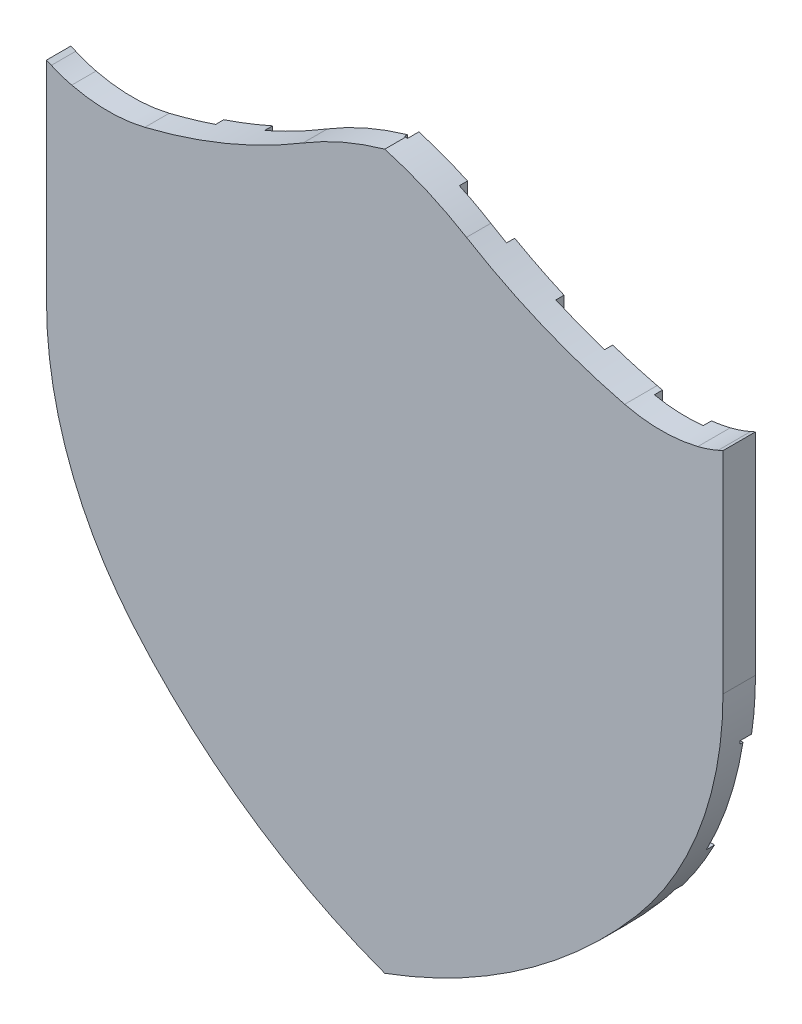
ISO-10303-21;
HEADER;
FILE_DESCRIPTION(('STEP AP214'),'2;1');
FILE_NAME('part.step','',(''),(''),'','','');
FILE_SCHEMA(('AUTOMOTIVE_DESIGN { 1 0 10303 214 1 1 1 1 }'));
ENDSEC;
DATA;
#1=APPLICATION_CONTEXT('core data for automotive mechanical design processes');
#2=APPLICATION_PROTOCOL_DEFINITION('international standard','automotive_design',2000,#1);
#3=PRODUCT_CONTEXT('',#1,'mechanical');
#4=PRODUCT('Part','Part','',(#3));
#5=PRODUCT_RELATED_PRODUCT_CATEGORY('part','',(#4));
#6=PRODUCT_DEFINITION_FORMATION('','',#4);
#7=PRODUCT_DEFINITION_CONTEXT('part definition',#1,'design');
#8=PRODUCT_DEFINITION('design','',#6,#7);
#9=PRODUCT_DEFINITION_SHAPE('','',#8);
#10=(LENGTH_UNIT() NAMED_UNIT(*) SI_UNIT(.MILLI.,.METRE.));
#11=(NAMED_UNIT(*) PLANE_ANGLE_UNIT() SI_UNIT($,.RADIAN.));
#12=(NAMED_UNIT(*) SI_UNIT($,.STERADIAN.) SOLID_ANGLE_UNIT());
#13=UNCERTAINTY_MEASURE_WITH_UNIT(LENGTH_MEASURE(1.E-05),#10,'distance_accuracy_value','');
#14=(GEOMETRIC_REPRESENTATION_CONTEXT(3) GLOBAL_UNCERTAINTY_ASSIGNED_CONTEXT((#13)) GLOBAL_UNIT_ASSIGNED_CONTEXT((#10,
#11,#12)) REPRESENTATION_CONTEXT('',''));
#15=CARTESIAN_POINT('',(0.,0.,0.));
#16=DIRECTION('',(0.,0.,1.));
#17=DIRECTION('',(1.,0.,0.));
#18=AXIS2_PLACEMENT_3D('',#15,#16,#17);
#19=CARTESIAN_POINT('',(144.045865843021,0.,-20.));
#20=DIRECTION('',(-1.,0.,0.));
#21=DIRECTION('',(0.,0.,1.));
#22=AXIS2_PLACEMENT_3D('',#19,#20,#21);
#23=PLANE('',#22);
#24=DIRECTION('',(0.,0.,1.));
#25=VECTOR('',#24,1.);
#26=CARTESIAN_POINT('',(144.045865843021,10.0669293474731,-15.));
#27=LINE('',#26,#25);
#28=CARTESIAN_POINT('',(144.045865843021,10.0669293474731,-15.));
#29=VERTEX_POINT('',#28);
#30=CARTESIAN_POINT('',(144.045865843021,10.0669293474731,-13.));
#31=VERTEX_POINT('',#30);
#32=EDGE_CURVE('E1030',#29,#31,#27,.T.);
#33=ORIENTED_EDGE('',*,*,#32,.T.);
#34=DIRECTION('',(0.,-1.,0.));
#35=VECTOR('',#34,1.);
#36=CARTESIAN_POINT('',(144.045865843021,0.,-13.));
#37=LINE('',#36,#35);
#38=CARTESIAN_POINT('',(144.045865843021,228.237383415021,-13.));
#39=VERTEX_POINT('',#38);
#40=EDGE_CURVE('E990',#39,#31,#37,.T.);
#41=ORIENTED_EDGE('',*,*,#40,.F.);
#42=DIRECTION('',(0.,0.,1.));
#43=VECTOR('',#42,1.);
#44=CARTESIAN_POINT('',(144.045865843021,228.237383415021,-15.));
#45=LINE('',#44,#43);
#46=CARTESIAN_POINT('',(144.045865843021,228.237383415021,-15.));
#47=VERTEX_POINT('',#46);
#48=EDGE_CURVE('E1044',#47,#39,#45,.T.);
#49=ORIENTED_EDGE('',*,*,#48,.F.);
#50=DIRECTION('',(0.,-1.,0.));
#51=VECTOR('',#50,1.);
#52=CARTESIAN_POINT('',(144.045865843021,0.,-15.));
#53=LINE('',#52,#51);
#54=CARTESIAN_POINT('',(144.045865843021,159.697349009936,-15.));
#55=VERTEX_POINT('',#54);
#56=EDGE_CURVE('E1036',#47,#55,#53,.T.);
#57=ORIENTED_EDGE('',*,*,#56,.T.);
#58=DIRECTION('',(0.,0.,1.));
#59=VECTOR('',#58,1.);
#60=CARTESIAN_POINT('',(144.045865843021,159.697349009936,-20.));
#61=LINE('',#60,#59);
#62=CARTESIAN_POINT('',(144.045865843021,159.697349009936,-20.));
#63=VERTEX_POINT('',#62);
#64=EDGE_CURVE('E1107',#63,#55,#61,.T.);
#65=ORIENTED_EDGE('',*,*,#64,.F.);
#66=DIRECTION('',(0.,-1.,0.));
#67=VECTOR('',#66,1.);
#68=CARTESIAN_POINT('',(144.045865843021,0.,-20.));
#69=LINE('',#68,#67);
#70=CARTESIAN_POINT('',(144.045865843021,128.605549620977,-20.));
#71=VERTEX_POINT('',#70);
#72=EDGE_CURVE('E1077',#63,#71,#69,.T.);
#73=ORIENTED_EDGE('',*,*,#72,.T.);
#74=DIRECTION('',(0.,0.,1.));
#75=VECTOR('',#74,1.);
#76=CARTESIAN_POINT('',(144.045865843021,128.605549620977,-20.));
#77=LINE('',#76,#75);
#78=CARTESIAN_POINT('',(144.045865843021,128.605549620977,-15.));
#79=VERTEX_POINT('',#78);
#80=EDGE_CURVE('E1104',#71,#79,#77,.T.);
#81=ORIENTED_EDGE('',*,*,#80,.T.);
#82=DIRECTION('',(0.,-1.,0.));
#83=VECTOR('',#82,1.);
#84=CARTESIAN_POINT('',(144.045865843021,0.,-15.));
#85=LINE('',#84,#83);
#86=EDGE_CURVE('E1027',#79,#29,#85,.T.);
#87=ORIENTED_EDGE('',*,*,#86,.T.);
#88=EDGE_LOOP('',(#33,#41,#49,#57,#65,#73,#81,#87));
#89=FACE_BOUND('',#88,.T.);
#90=ADVANCED_FACE('F35',(#89),#23,.T.);
#91=CARTESIAN_POINT('',(0.,228.237383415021,-20.));
#92=DIRECTION('',(0.,1.,0.));
#93=DIRECTION('',(0.,0.,1.));
#94=AXIS2_PLACEMENT_3D('',#91,#92,#93);
#95=PLANE('',#94);
#96=ORIENTED_EDGE('',*,*,#48,.T.);
#97=DIRECTION('',(-1.,0.,0.));
#98=VECTOR('',#97,1.);
#99=CARTESIAN_POINT('',(0.,228.237383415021,-13.));
#100=LINE('',#99,#98);
#101=CARTESIAN_POINT('',(348.654593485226,228.237383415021,-13.));
#102=VERTEX_POINT('',#101);
#103=EDGE_CURVE('E992',#102,#39,#100,.T.);
#104=ORIENTED_EDGE('',*,*,#103,.F.);
#105=DIRECTION('',(0.,0.,1.));
#106=VECTOR('',#105,1.);
#107=CARTESIAN_POINT('',(348.654593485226,228.237383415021,-15.));
#108=LINE('',#107,#106);
#109=CARTESIAN_POINT('',(348.654593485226,228.237383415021,-15.));
#110=VERTEX_POINT('',#109);
#111=EDGE_CURVE('E1057',#110,#102,#108,.T.);
#112=ORIENTED_EDGE('',*,*,#111,.F.);
#113=DIRECTION('',(-1.,0.,0.));
#114=VECTOR('',#113,1.);
#115=CARTESIAN_POINT('',(0.,228.237383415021,-15.));
#116=LINE('',#115,#114);
#117=CARTESIAN_POINT('',(263.413544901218,228.237383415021,-15.));
#118=VERTEX_POINT('',#117);
#119=EDGE_CURVE('E1049',#110,#118,#116,.T.);
#120=ORIENTED_EDGE('',*,*,#119,.T.);
#121=DIRECTION('',(0.,0.,1.));
#122=VECTOR('',#121,1.);
#123=CARTESIAN_POINT('',(263.413544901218,228.237383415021,-20.));
#124=LINE('',#123,#122);
#125=CARTESIAN_POINT('',(263.413544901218,228.237383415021,-20.));
#126=VERTEX_POINT('',#125);
#127=EDGE_CURVE('E1116',#126,#118,#124,.T.);
#128=ORIENTED_EDGE('',*,*,#127,.F.);
#129=DIRECTION('',(-1.,0.,0.));
#130=VECTOR('',#129,1.);
#131=CARTESIAN_POINT('',(0.,228.237383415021,-20.));
#132=LINE('',#131,#130);
#133=CARTESIAN_POINT('',(233.454336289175,228.237383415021,-20.));
#134=VERTEX_POINT('',#133);
#135=EDGE_CURVE('E1069',#126,#134,#132,.T.);
#136=ORIENTED_EDGE('',*,*,#135,.T.);
#137=DIRECTION('',(0.,0.,1.));
#138=VECTOR('',#137,1.);
#139=CARTESIAN_POINT('',(233.454336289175,228.237383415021,-20.));
#140=LINE('',#139,#138);
#141=CARTESIAN_POINT('',(233.454336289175,228.237383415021,-15.));
#142=VERTEX_POINT('',#141);
#143=EDGE_CURVE('E1113',#134,#142,#140,.T.);
#144=ORIENTED_EDGE('',*,*,#143,.T.);
#145=DIRECTION('',(-1.,0.,0.));
#146=VECTOR('',#145,1.);
#147=CARTESIAN_POINT('',(0.,228.237383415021,-15.));
#148=LINE('',#147,#146);
#149=EDGE_CURVE('E1033',#142,#47,#148,.T.);
#150=ORIENTED_EDGE('',*,*,#149,.T.);
#151=EDGE_LOOP('',(#96,#104,#112,#120,#128,#136,#144,#150));
#152=FACE_BOUND('',#151,.T.);
#153=ADVANCED_FACE('F1138',(#152),#95,.T.);
#154=CARTESIAN_POINT('',(0.,128.605549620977,-20.));
#155=DIRECTION('',(0.,-1.,0.));
#156=DIRECTION('',(0.,0.,-1.));
#157=AXIS2_PLACEMENT_3D('',#154,#155,#156);
#158=PLANE('',#157);
#159=DIRECTION('',(0.,0.,1.));
#160=VECTOR('',#159,1.);
#161=CARTESIAN_POINT('',(306.605446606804,128.605549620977,-20.));
#162=LINE('',#161,#160);
#163=CARTESIAN_POINT('',(306.605446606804,128.605549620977,-20.));
#164=VERTEX_POINT('',#163);
#165=CARTESIAN_POINT('',(306.605446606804,128.605549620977,-15.));
#166=VERTEX_POINT('',#165);
#167=EDGE_CURVE('E11',#164,#166,#162,.T.);
#168=ORIENTED_EDGE('',*,*,#167,.T.);
#169=DIRECTION('',(1.,0.,0.));
#170=VECTOR('',#169,1.);
#171=CARTESIAN_POINT('',(0.,128.605549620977,-15.));
#172=LINE('',#171,#170);
#173=CARTESIAN_POINT('',(263.413544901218,128.605549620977,-15.));
#174=VERTEX_POINT('',#173);
#175=EDGE_CURVE('E1012',#174,#166,#172,.T.);
#176=ORIENTED_EDGE('',*,*,#175,.F.);
#177=DIRECTION('',(0.,0.,1.));
#178=VECTOR('',#177,1.);
#179=CARTESIAN_POINT('',(263.413544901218,128.605549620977,-20.));
#180=LINE('',#179,#178);
#181=CARTESIAN_POINT('',(263.413544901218,128.605549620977,-20.));
#182=VERTEX_POINT('',#181);
#183=EDGE_CURVE('E44',#182,#174,#180,.T.);
#184=ORIENTED_EDGE('',*,*,#183,.F.);
#185=DIRECTION('',(1.,0.,0.));
#186=VECTOR('',#185,1.);
#187=CARTESIAN_POINT('',(0.,128.605549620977,-20.));
#188=LINE('',#187,#186);
#189=EDGE_CURVE('E1090',#182,#164,#188,.T.);
#190=ORIENTED_EDGE('',*,*,#189,.T.);
#191=EDGE_LOOP('',(#168,#176,#184,#190));
#192=FACE_BOUND('',#191,.T.);
#193=ADVANCED_FACE('F1172',(#192),#158,.T.);
#194=CARTESIAN_POINT('',(263.413544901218,0.,-20.));
#195=DIRECTION('',(1.,0.,0.));
#196=DIRECTION('',(0.,0.,-1.));
#197=AXIS2_PLACEMENT_3D('',#194,#195,#196);
#198=PLANE('',#197);
#199=ORIENTED_EDGE('',*,*,#183,.T.);
#200=DIRECTION('',(0.,1.,0.));
#201=VECTOR('',#200,1.);
#202=CARTESIAN_POINT('',(263.413544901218,0.,-15.));
#203=LINE('',#202,#201);
#204=CARTESIAN_POINT('',(263.413544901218,82.2789352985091,-15.));
#205=VERTEX_POINT('',#204);
#206=EDGE_CURVE('E1014',#205,#174,#203,.T.);
#207=ORIENTED_EDGE('',*,*,#206,.F.);
#208=DIRECTION('',(0.,0.,1.));
#209=VECTOR('',#208,1.);
#210=CARTESIAN_POINT('',(263.413544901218,82.2789352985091,-20.));
#211=LINE('',#210,#209);
#212=CARTESIAN_POINT('',(263.413544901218,82.2789352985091,-20.));
#213=VERTEX_POINT('',#212);
#214=EDGE_CURVE('E1098',#213,#205,#211,.T.);
#215=ORIENTED_EDGE('',*,*,#214,.F.);
#216=DIRECTION('',(0.,1.,0.));
#217=VECTOR('',#216,1.);
#218=CARTESIAN_POINT('',(263.413544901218,0.,-20.));
#219=LINE('',#218,#217);
#220=EDGE_CURVE('E1087',#213,#182,#219,.T.);
#221=ORIENTED_EDGE('',*,*,#220,.T.);
#222=EDGE_LOOP('',(#199,#207,#215,#221));
#223=FACE_BOUND('',#222,.T.);
#224=ADVANCED_FACE('F1177',(#223),#198,.T.);
#225=CARTESIAN_POINT('',(233.454336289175,-7.34321019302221E-13,-20.));
#226=DIRECTION('',(1.,0.,0.));
#227=DIRECTION('',(0.,1.,0.));
#228=AXIS2_PLACEMENT_3D('',#225,#226,#227);
#229=PLANE('',#228);
#230=DIRECTION('',(0.,1.,0.));
#231=VECTOR('',#230,1.);
#232=CARTESIAN_POINT('',(233.454336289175,-7.34321019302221E-13,-15.));
#233=LINE('',#232,#231);
#234=CARTESIAN_POINT('',(233.454336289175,58.0134318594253,-15.));
#235=VERTEX_POINT('',#234);
#236=CARTESIAN_POINT('',(233.454336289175,128.605549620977,-15.));
#237=VERTEX_POINT('',#236);
#238=EDGE_CURVE('E57',#235,#237,#233,.T.);
#239=ORIENTED_EDGE('',*,*,#238,.T.);
#240=DIRECTION('',(0.,0.,1.));
#241=VECTOR('',#240,1.);
#242=CARTESIAN_POINT('',(233.454336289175,128.605549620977,-20.));
#243=LINE('',#242,#241);
#244=CARTESIAN_POINT('',(233.454336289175,128.605549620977,-20.));
#245=VERTEX_POINT('',#244);
#246=EDGE_CURVE('E1102',#245,#237,#243,.T.);
#247=ORIENTED_EDGE('',*,*,#246,.F.);
#248=DIRECTION('',(0.,1.,0.));
#249=VECTOR('',#248,1.);
#250=CARTESIAN_POINT('',(233.454336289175,-7.34321019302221E-13,-20.));
#251=LINE('',#250,#249);
#252=CARTESIAN_POINT('',(233.454336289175,58.0134318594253,-20.));
#253=VERTEX_POINT('',#252);
#254=EDGE_CURVE('E1083',#253,#245,#251,.T.);
#255=ORIENTED_EDGE('',*,*,#254,.F.);
#256=DIRECTION('',(0.,0.,1.));
#257=VECTOR('',#256,1.);
#258=CARTESIAN_POINT('',(233.454336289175,58.0134318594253,-20.));
#259=LINE('',#258,#257);
#260=EDGE_CURVE('E52',#253,#235,#259,.T.);
#261=ORIENTED_EDGE('',*,*,#260,.T.);
#262=EDGE_LOOP('',(#239,#247,#255,#261));
#263=FACE_BOUND('',#262,.T.);
#264=ADVANCED_FACE('F1164',(#263),#229,.F.);
#265=CARTESIAN_POINT('',(0.,128.605549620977,-20.));
#266=DIRECTION('',(0.,-1.,0.));
#267=DIRECTION('',(0.,0.,-1.));
#268=AXIS2_PLACEMENT_3D('',#265,#266,#267);
#269=PLANE('',#268);
#270=ORIENTED_EDGE('',*,*,#246,.T.);
#271=DIRECTION('',(1.,0.,0.));
#272=VECTOR('',#271,1.);
#273=CARTESIAN_POINT('',(0.,128.605549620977,-15.));
#274=LINE('',#273,#272);
#275=EDGE_CURVE('E1024',#79,#237,#274,.T.);
#276=ORIENTED_EDGE('',*,*,#275,.F.);
#277=ORIENTED_EDGE('',*,*,#80,.F.);
#278=DIRECTION('',(1.,0.,0.));
#279=VECTOR('',#278,1.);
#280=CARTESIAN_POINT('',(0.,128.605549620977,-20.));
#281=LINE('',#280,#279);
#282=EDGE_CURVE('E1080',#71,#245,#281,.T.);
#283=ORIENTED_EDGE('',*,*,#282,.T.);
#284=EDGE_LOOP('',(#270,#276,#277,#283));
#285=FACE_BOUND('',#284,.T.);
#286=ADVANCED_FACE('F1157',(#285),#269,.T.);
#287=CARTESIAN_POINT('',(0.,159.697349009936,-20.));
#288=DIRECTION('',(0.,1.,0.));
#289=DIRECTION('',(-1.,0.,0.));
#290=AXIS2_PLACEMENT_3D('',#287,#288,#289);
#291=PLANE('',#290);
#292=ORIENTED_EDGE('',*,*,#64,.T.);
#293=DIRECTION('',(-1.,0.,0.));
#294=VECTOR('',#293,1.);
#295=CARTESIAN_POINT('',(0.,159.697349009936,-15.));
#296=LINE('',#295,#294);
#297=CARTESIAN_POINT('',(233.454336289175,159.697349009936,-15.));
#298=VERTEX_POINT('',#297);
#299=EDGE_CURVE('E1039',#298,#55,#296,.T.);
#300=ORIENTED_EDGE('',*,*,#299,.F.);
#301=DIRECTION('',(0.,0.,1.));
#302=VECTOR('',#301,1.);
#303=CARTESIAN_POINT('',(233.454336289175,159.697349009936,-20.));
#304=LINE('',#303,#302);
#305=CARTESIAN_POINT('',(233.454336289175,159.697349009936,-20.));
#306=VERTEX_POINT('',#305);
#307=EDGE_CURVE('E1110',#306,#298,#304,.T.);
#308=ORIENTED_EDGE('',*,*,#307,.F.);
#309=DIRECTION('',(-1.,0.,0.));
#310=VECTOR('',#309,1.);
#311=CARTESIAN_POINT('',(0.,159.697349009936,-20.));
#312=LINE('',#311,#310);
#313=EDGE_CURVE('E1074',#306,#63,#312,.T.);
#314=ORIENTED_EDGE('',*,*,#313,.T.);
#315=EDGE_LOOP('',(#292,#300,#308,#314));
#316=FACE_BOUND('',#315,.T.);
#317=ADVANCED_FACE('F1155',(#316),#291,.T.);
#318=CARTESIAN_POINT('',(233.454336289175,1.89076633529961E-13,-20.));
#319=DIRECTION('',(1.,0.,0.));
#320=DIRECTION('',(0.,1.,0.));
#321=AXIS2_PLACEMENT_3D('',#318,#319,#320);
#322=PLANE('',#321);
#323=DIRECTION('',(0.,1.,0.));
#324=VECTOR('',#323,1.);
#325=CARTESIAN_POINT('',(233.454336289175,1.89076633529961E-13,-15.));
#326=LINE('',#325,#324);
#327=EDGE_CURVE('E1041',#298,#142,#326,.T.);
#328=ORIENTED_EDGE('',*,*,#327,.T.);
#329=ORIENTED_EDGE('',*,*,#143,.F.);
#330=DIRECTION('',(0.,1.,0.));
#331=VECTOR('',#330,1.);
#332=CARTESIAN_POINT('',(233.454336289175,1.89076633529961E-13,-20.));
#333=LINE('',#332,#331);
#334=EDGE_CURVE('E1072',#306,#134,#333,.T.);
#335=ORIENTED_EDGE('',*,*,#334,.F.);
#336=ORIENTED_EDGE('',*,*,#307,.T.);
#337=EDGE_LOOP('',(#328,#329,#335,#336));
#338=FACE_BOUND('',#337,.T.);
#339=ADVANCED_FACE('F1146',(#338),#322,.F.);
#340=CARTESIAN_POINT('',(263.413544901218,0.,-20.));
#341=DIRECTION('',(1.,0.,0.));
#342=DIRECTION('',(0.,0.,-1.));
#343=AXIS2_PLACEMENT_3D('',#340,#341,#342);
#344=PLANE('',#343);
#345=ORIENTED_EDGE('',*,*,#127,.T.);
#346=DIRECTION('',(0.,1.,0.));
#347=VECTOR('',#346,1.);
#348=CARTESIAN_POINT('',(263.413544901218,0.,-15.));
#349=LINE('',#348,#347);
#350=CARTESIAN_POINT('',(263.413544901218,159.697349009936,-15.));
#351=VERTEX_POINT('',#350);
#352=EDGE_CURVE('E1052',#351,#118,#349,.T.);
#353=ORIENTED_EDGE('',*,*,#352,.F.);
#354=DIRECTION('',(0.,0.,1.));
#355=VECTOR('',#354,1.);
#356=CARTESIAN_POINT('',(263.413544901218,159.697349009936,-20.));
#357=LINE('',#356,#355);
#358=CARTESIAN_POINT('',(263.413544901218,159.697349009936,-20.));
#359=VERTEX_POINT('',#358);
#360=EDGE_CURVE('E1118',#359,#351,#357,.T.);
#361=ORIENTED_EDGE('',*,*,#360,.F.);
#362=DIRECTION('',(0.,1.,0.));
#363=VECTOR('',#362,1.);
#364=CARTESIAN_POINT('',(263.413544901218,0.,-20.));
#365=LINE('',#364,#363);
#366=EDGE_CURVE('E1066',#359,#126,#365,.T.);
#367=ORIENTED_EDGE('',*,*,#366,.T.);
#368=EDGE_LOOP('',(#345,#353,#361,#367));
#369=FACE_BOUND('',#368,.T.);
#370=ADVANCED_FACE('F1135',(#369),#344,.T.);
#371=CARTESIAN_POINT('',(0.,159.697349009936,-20.));
#372=DIRECTION('',(0.,-1.,0.));
#373=DIRECTION('',(0.,0.,-1.));
#374=AXIS2_PLACEMENT_3D('',#371,#372,#373);
#375=PLANE('',#374);
#376=DIRECTION('',(1.,0.,0.));
#377=VECTOR('',#376,1.);
#378=CARTESIAN_POINT('',(0.,159.697349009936,-15.));
#379=LINE('',#378,#377);
#380=CARTESIAN_POINT('',(326.156478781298,159.697349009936,-15.));
#381=VERTEX_POINT('',#380);
#382=EDGE_CURVE('E1054',#351,#381,#379,.T.);
#383=ORIENTED_EDGE('',*,*,#382,.T.);
#384=DIRECTION('',(0.,0.,1.));
#385=VECTOR('',#384,1.);
#386=CARTESIAN_POINT('',(326.156478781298,159.697349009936,-20.));
#387=LINE('',#386,#385);
#388=CARTESIAN_POINT('',(326.156478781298,159.697349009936,-20.));
#389=VERTEX_POINT('',#388);
#390=EDGE_CURVE('E39',#389,#381,#387,.T.);
#391=ORIENTED_EDGE('',*,*,#390,.F.);
#392=DIRECTION('',(1.,0.,0.));
#393=VECTOR('',#392,1.);
#394=CARTESIAN_POINT('',(0.,159.697349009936,-20.));
#395=LINE('',#394,#393);
#396=EDGE_CURVE('E1063',#359,#389,#395,.T.);
#397=ORIENTED_EDGE('',*,*,#396,.F.);
#398=ORIENTED_EDGE('',*,*,#360,.T.);
#399=EDGE_LOOP('',(#383,#391,#397,#398));
#400=FACE_BOUND('',#399,.T.);
#401=ADVANCED_FACE('F1129',(#400),#375,.F.);
#402=CARTESIAN_POINT('',(127.681306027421,262.808880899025,-20.));
#403=DIRECTION('',(0.,0.,1.));
#404=DIRECTION('',(1.,0.,0.));
#405=AXIS2_PLACEMENT_3D('',#402,#403,#404);
#406=CYLINDRICAL_SURFACE('',#405,223.661311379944);
#407=CARTESIAN_POINT('',(127.681306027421,262.808880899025,0.));
#408=DIRECTION('',(0.,0.,1.));
#409=DIRECTION('',(1.,0.,0.));
#410=AXIS2_PLACEMENT_3D('',#407,#408,#409);
#411=CIRCLE('',#410,223.661311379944);
#412=CARTESIAN_POINT('',(351.342617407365,262.808880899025,0.));
#413=VERTEX_POINT('',#412);
#414=CARTESIAN_POINT('',(298.130357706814,117.993470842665,0.));
#415=VERTEX_POINT('',#414);
#416=EDGE_CURVE('E1060',#413,#415,#411,.F.);
#417=ORIENTED_EDGE('',*,*,#416,.T.);
#418=DIRECTION('',(0.,0.,1.));
#419=VECTOR('',#418,1.);
#420=CARTESIAN_POINT('',(298.130357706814,117.993470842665,-15.));
#421=LINE('',#420,#419);
#422=CARTESIAN_POINT('',(298.130357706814,117.993470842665,-15.));
#423=VERTEX_POINT('',#422);
#424=EDGE_CURVE('E1018',#423,#415,#421,.T.);
#425=ORIENTED_EDGE('',*,*,#424,.F.);
#426=CARTESIAN_POINT('',(127.681306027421,262.808880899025,-15.));
#427=DIRECTION('',(0.,0.,1.));
#428=DIRECTION('',(1.,0.,0.));
#429=AXIS2_PLACEMENT_3D('',#426,#427,#428);
#430=CIRCLE('',#429,223.661311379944);
#431=EDGE_CURVE('E1008',#166,#423,#430,.F.);
#432=ORIENTED_EDGE('',*,*,#431,.F.);
#433=ORIENTED_EDGE('',*,*,#167,.F.);
#434=CARTESIAN_POINT('',(127.681306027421,262.808880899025,-20.));
#435=DIRECTION('',(0.,0.,1.));
#436=DIRECTION('',(1.,0.,0.));
#437=AXIS2_PLACEMENT_3D('',#434,#435,#436);
#438=CIRCLE('',#437,223.661311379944);
#439=EDGE_CURVE('E1061',#389,#164,#438,.F.);
#440=ORIENTED_EDGE('',*,*,#439,.F.);
#441=ORIENTED_EDGE('',*,*,#390,.T.);
#442=CARTESIAN_POINT('',(127.681306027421,262.808880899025,-15.));
#443=DIRECTION('',(0.,0.,1.));
#444=DIRECTION('',(1.,0.,0.));
#445=AXIS2_PLACEMENT_3D('',#442,#443,#444);
#446=CIRCLE('',#445,223.661311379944);
#447=EDGE_CURVE('E1047',#110,#381,#446,.F.);
#448=ORIENTED_EDGE('',*,*,#447,.F.);
#449=ORIENTED_EDGE('',*,*,#111,.T.);
#450=CARTESIAN_POINT('',(127.681306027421,262.808880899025,-13.));
#451=DIRECTION('',(0.,0.,1.));
#452=DIRECTION('',(1.,0.,0.));
#453=AXIS2_PLACEMENT_3D('',#450,#451,#452);
#454=CIRCLE('',#453,223.661311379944);
#455=CARTESIAN_POINT('',(348.95823604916,230.237383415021,-13.));
#456=VERTEX_POINT('',#455);
#457=EDGE_CURVE('E957',#456,#102,#454,.F.);
#458=ORIENTED_EDGE('',*,*,#457,.F.);
#459=DIRECTION('',(0.,0.,1.));
#460=VECTOR('',#459,1.);
#461=CARTESIAN_POINT('',(348.95823604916,230.237383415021,-20.));
#462=LINE('',#461,#460);
#463=CARTESIAN_POINT('',(348.95823604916,230.237383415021,-20.));
#464=VERTEX_POINT('',#463);
#465=EDGE_CURVE('E665',#464,#456,#462,.T.);
#466=ORIENTED_EDGE('',*,*,#465,.F.);
#467=CARTESIAN_POINT('',(127.681306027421,262.808880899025,-20.));
#468=DIRECTION('',(0.,0.,1.));
#469=DIRECTION('',(1.,0.,0.));
#470=AXIS2_PLACEMENT_3D('',#467,#468,#469);
#471=CIRCLE('',#470,223.661311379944);
#472=CARTESIAN_POINT('',(351.342617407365,262.808880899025,-20.));
#473=VERTEX_POINT('',#472);
#474=EDGE_CURVE('E635',#473,#464,#471,.F.);
#475=ORIENTED_EDGE('',*,*,#474,.F.);
#476=DIRECTION('',(0.,0.,1.));
#477=VECTOR('',#476,1.);
#478=CARTESIAN_POINT('',(351.342617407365,262.808880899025,-20.));
#479=LINE('',#478,#477);
#480=EDGE_CURVE('E655',#473,#413,#479,.T.);
#481=ORIENTED_EDGE('',*,*,#480,.T.);
#482=EDGE_LOOP('',(#417,#425,#432,#433,#440,#441,#448,#449,#458,#466,#475,#481));
#483=FACE_BOUND('',#482,.T.);
#484=ADVANCED_FACE('F37',(#483),#406,.T.);
#485=CARTESIAN_POINT('',(14.5048414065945,358.964863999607,-20.));
#486=DIRECTION('',(0.,0.,1.));
#487=DIRECTION('',(1.,0.,0.));
#488=AXIS2_PLACEMENT_3D('',#485,#486,#487);
#489=CYLINDRICAL_SURFACE('',#488,372.170183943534);
#490=CARTESIAN_POINT('',(14.5048414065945,358.964863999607,0.));
#491=DIRECTION('',(0.,0.,1.));
#492=DIRECTION('',(1.,0.,0.));
#493=AXIS2_PLACEMENT_3D('',#490,#491,#492);
#494=CIRCLE('',#493,372.170183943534);
#495=CARTESIAN_POINT('',(143.045865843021,9.69727195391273,0.));
#496=VERTEX_POINT('',#495);
#497=EDGE_CURVE('E1064',#415,#496,#494,.F.);
#498=ORIENTED_EDGE('',*,*,#497,.T.);
#499=DIRECTION('',(0.,0.,1.));
#500=VECTOR('',#499,1.);
#501=CARTESIAN_POINT('',(143.045865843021,9.69727195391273,-13.));
#502=LINE('',#501,#500);
#503=CARTESIAN_POINT('',(143.045865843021,9.69727195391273,-13.));
#504=VERTEX_POINT('',#503);
#505=EDGE_CURVE('E1005',#504,#496,#502,.T.);
#506=ORIENTED_EDGE('',*,*,#505,.F.);
#507=CARTESIAN_POINT('',(14.5048414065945,358.964863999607,-13.));
#508=DIRECTION('',(0.,0.,1.));
#509=DIRECTION('',(1.,0.,0.));
#510=AXIS2_PLACEMENT_3D('',#507,#508,#509);
#511=CIRCLE('',#510,372.170183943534);
#512=EDGE_CURVE('E988',#31,#504,#511,.F.);
#513=ORIENTED_EDGE('',*,*,#512,.F.);
#514=ORIENTED_EDGE('',*,*,#32,.F.);
#515=CARTESIAN_POINT('',(14.5048414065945,358.964863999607,-15.));
#516=DIRECTION('',(0.,0.,1.));
#517=DIRECTION('',(1.,0.,0.));
#518=AXIS2_PLACEMENT_3D('',#515,#516,#517);
#519=CIRCLE('',#518,372.170183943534);
#520=EDGE_CURVE('E1021',#235,#29,#519,.F.);
#521=ORIENTED_EDGE('',*,*,#520,.F.);
#522=ORIENTED_EDGE('',*,*,#260,.F.);
#523=CARTESIAN_POINT('',(14.5048414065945,358.964863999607,-20.));
#524=DIRECTION('',(0.,0.,1.));
#525=DIRECTION('',(1.,0.,0.));
#526=AXIS2_PLACEMENT_3D('',#523,#524,#525);
#527=CIRCLE('',#526,372.170183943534);
#528=EDGE_CURVE('E1085',#213,#253,#527,.F.);
#529=ORIENTED_EDGE('',*,*,#528,.F.);
#530=ORIENTED_EDGE('',*,*,#214,.T.);
#531=CARTESIAN_POINT('',(14.5048414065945,358.964863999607,-15.));
#532=DIRECTION('',(0.,0.,1.));
#533=DIRECTION('',(1.,0.,0.));
#534=AXIS2_PLACEMENT_3D('',#531,#532,#533);
#535=CIRCLE('',#534,372.170183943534);
#536=EDGE_CURVE('E1016',#423,#205,#535,.F.);
#537=ORIENTED_EDGE('',*,*,#536,.F.);
#538=ORIENTED_EDGE('',*,*,#424,.T.);
#539=EDGE_LOOP('',(#498,#506,#513,#514,#521,#522,#529,#530,#537,#538));
#540=FACE_BOUND('',#539,.T.);
#541=ADVANCED_FACE('F1178',(#540),#489,.T.);
#542=CARTESIAN_POINT('',(0.,0.,-20.));
#543=DIRECTION('',(0.,0.,1.));
#544=DIRECTION('',(1.,0.,0.));
#545=AXIS2_PLACEMENT_3D('',#542,#543,#544);
#546=PLANE('',#545);
#547=ORIENTED_EDGE('',*,*,#439,.T.);
#548=ORIENTED_EDGE('',*,*,#189,.F.);
#549=ORIENTED_EDGE('',*,*,#220,.F.);
#550=ORIENTED_EDGE('',*,*,#528,.T.);
#551=ORIENTED_EDGE('',*,*,#254,.T.);
#552=ORIENTED_EDGE('',*,*,#282,.F.);
#553=ORIENTED_EDGE('',*,*,#72,.F.);
#554=ORIENTED_EDGE('',*,*,#313,.F.);
#555=ORIENTED_EDGE('',*,*,#334,.T.);
#556=ORIENTED_EDGE('',*,*,#135,.F.);
#557=ORIENTED_EDGE('',*,*,#366,.F.);
#558=ORIENTED_EDGE('',*,*,#396,.T.);
#559=EDGE_LOOP('',(#547,#548,#549,#550,#551,#552,#553,#554,#555,#556,#557,#558));
#560=FACE_BOUND('',#559,.T.);
#561=ADVANCED_FACE('F1140',(#560),#546,.F.);
#562=CARTESIAN_POINT('',(0.,0.,0.));
#563=DIRECTION('',(0.,0.,1.));
#564=DIRECTION('',(1.,0.,0.));
#565=AXIS2_PLACEMENT_3D('',#562,#563,#564);
#566=PLANE('',#565);
#567=CARTESIAN_POINT('',(158.410425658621,262.808880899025,0.));
#568=DIRECTION('',(0.,0.,1.));
#569=DIRECTION('',(1.,0.,0.));
#570=AXIS2_PLACEMENT_3D('',#567,#568,#569);
#571=CIRCLE('',#570,223.661311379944);
#572=CARTESIAN_POINT('',(-65.2508857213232,262.808880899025,0.));
#573=VERTEX_POINT('',#572);
#574=CARTESIAN_POINT('',(-12.0386260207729,117.993470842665,0.));
#575=VERTEX_POINT('',#574);
#576=EDGE_CURVE('E1000',#573,#575,#571,.T.);
#577=ORIENTED_EDGE('',*,*,#576,.T.);
#578=CARTESIAN_POINT('',(271.586890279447,358.964863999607,0.));
#579=DIRECTION('',(0.,0.,1.));
#580=DIRECTION('',(1.,0.,0.));
#581=AXIS2_PLACEMENT_3D('',#578,#579,#580);
#582=CIRCLE('',#581,372.170183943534);
#583=EDGE_CURVE('E960',#575,#496,#582,.T.);
#584=ORIENTED_EDGE('',*,*,#583,.T.);
#585=ORIENTED_EDGE('',*,*,#497,.F.);
#586=ORIENTED_EDGE('',*,*,#416,.F.);
#587=DIRECTION('',(0.,-1.,0.));
#588=VECTOR('',#587,1.);
#589=CARTESIAN_POINT('',(351.342617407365,0.,0.));
#590=LINE('',#589,#588);
#591=CARTESIAN_POINT('',(351.342617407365,392.630681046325,0.));
#592=VERTEX_POINT('',#591);
#593=EDGE_CURVE('E634',#592,#413,#590,.T.);
#594=ORIENTED_EDGE('',*,*,#593,.F.);
#595=DIRECTION('',(-0.914871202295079,-0.403745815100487,0.));
#596=VECTOR('',#595,1.);
#597=CARTESIAN_POINT('',(-87.7555223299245,198.850358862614,0.));
#598=LINE('',#597,#596);
#599=CARTESIAN_POINT('',(348.369624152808,391.318656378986,0.));
#600=VERTEX_POINT('',#599);
#601=EDGE_CURVE('E658',#592,#600,#598,.T.);
#602=ORIENTED_EDGE('',*,*,#601,.T.);
#603=CARTESIAN_POINT('',(317.588345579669,461.067751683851,0.));
#604=DIRECTION('',(0.,0.,1.));
#605=DIRECTION('',(1.,0.,0.));
#606=AXIS2_PLACEMENT_3D('',#603,#604,#605);
#607=CIRCLE('',#606,76.2392510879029);
#608=CARTESIAN_POINT('',(335.830563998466,387.043128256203,0.));
#609=VERTEX_POINT('',#608);
#610=EDGE_CURVE('E661',#600,#609,#607,.F.);
#611=ORIENTED_EDGE('',*,*,#610,.T.);
#612=CARTESIAN_POINT('',(313.307605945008,478.438453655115,0.));
#613=DIRECTION('',(0.,0.,1.));
#614=DIRECTION('',(1.,0.,0.));
#615=AXIS2_PLACEMENT_3D('',#612,#613,#614);
#616=CIRCLE('',#615,94.1296400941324);
#617=CARTESIAN_POINT('',(290.784647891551,387.043128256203,0.));
#618=VERTEX_POINT('',#617);
#619=EDGE_CURVE('E639',#609,#618,#616,.F.);
#620=ORIENTED_EDGE('',*,*,#619,.T.);
#621=CARTESIAN_POINT('',(374.548132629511,726.944793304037,0.));
#622=DIRECTION('',(0.,0.,1.));
#623=DIRECTION('',(1.,0.,0.));
#624=AXIS2_PLACEMENT_3D('',#621,#622,#623);
#625=CIRCLE('',#624,350.070654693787);
#626=CARTESIAN_POINT('',(193.378024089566,427.400380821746,0.));
#627=VERTEX_POINT('',#626);
#628=EDGE_CURVE('E592',#618,#627,#625,.F.);
#629=ORIENTED_EDGE('',*,*,#628,.T.);
#630=CARTESIAN_POINT('',(87.2172479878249,251.87546911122,0.));
#631=DIRECTION('',(0.,0.,1.));
#632=DIRECTION('',(1.,0.,0.));
#633=AXIS2_PLACEMENT_3D('',#630,#631,#632);
#634=CIRCLE('',#633,205.131921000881);
#635=CARTESIAN_POINT('',(143.045865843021,449.264097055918,0.));
#636=VERTEX_POINT('',#635);
#637=EDGE_CURVE('E926',#627,#636,#634,.T.);
#638=ORIENTED_EDGE('',*,*,#637,.T.);
#639=CARTESIAN_POINT('',(198.874483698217,251.87546911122,0.));
#640=DIRECTION('',(0.,0.,1.));
#641=DIRECTION('',(1.,0.,0.));
#642=AXIS2_PLACEMENT_3D('',#639,#640,#641);
#643=CIRCLE('',#642,205.131921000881);
#644=CARTESIAN_POINT('',(92.7137075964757,427.400380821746,0.));
#645=VERTEX_POINT('',#644);
#646=EDGE_CURVE('E997',#645,#636,#643,.F.);
#647=ORIENTED_EDGE('',*,*,#646,.F.);
#648=CARTESIAN_POINT('',(-88.4564009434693,726.944793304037,0.));
#649=DIRECTION('',(0.,0.,1.));
#650=DIRECTION('',(1.,0.,0.));
#651=AXIS2_PLACEMENT_3D('',#648,#649,#650);
#652=CIRCLE('',#651,350.070654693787);
#653=CARTESIAN_POINT('',(-4.69291620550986,387.043128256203,0.));
#654=VERTEX_POINT('',#653);
#655=EDGE_CURVE('E889',#654,#645,#652,.T.);
#656=ORIENTED_EDGE('',*,*,#655,.F.);
#657=CARTESIAN_POINT('',(-27.215874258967,478.438453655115,0.));
#658=DIRECTION('',(0.,0.,1.));
#659=DIRECTION('',(1.,0.,0.));
#660=AXIS2_PLACEMENT_3D('',#657,#658,#659);
#661=CIRCLE('',#660,94.1296400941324);
#662=CARTESIAN_POINT('',(-49.7388323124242,387.043128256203,0.));
#663=VERTEX_POINT('',#662);
#664=EDGE_CURVE('E797',#663,#654,#661,.T.);
#665=ORIENTED_EDGE('',*,*,#664,.F.);
#666=CARTESIAN_POINT('',(-31.4966138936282,461.067751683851,0.));
#667=DIRECTION('',(0.,0.,1.));
#668=DIRECTION('',(1.,0.,0.));
#669=AXIS2_PLACEMENT_3D('',#666,#667,#668);
#670=CIRCLE('',#669,76.2392510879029);
#671=CARTESIAN_POINT('',(-62.2778924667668,391.318656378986,0.));
#672=VERTEX_POINT('',#671);
#673=EDGE_CURVE('E825',#672,#663,#670,.T.);
#674=ORIENTED_EDGE('',*,*,#673,.F.);
#675=DIRECTION('',(0.914871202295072,-0.403745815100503,0.));
#676=VECTOR('',#675,1.);
#677=CARTESIAN_POINT('',(134.391530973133,304.525612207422,0.));
#678=LINE('',#677,#676);
#679=CARTESIAN_POINT('',(-65.2508857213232,392.630681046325,0.));
#680=VERTEX_POINT('',#679);
#681=EDGE_CURVE('E809',#680,#672,#678,.T.);
#682=ORIENTED_EDGE('',*,*,#681,.F.);
#683=DIRECTION('',(0.,-1.,0.));
#684=VECTOR('',#683,1.);
#685=CARTESIAN_POINT('',(-65.2508857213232,0.,0.));
#686=LINE('',#685,#684);
#687=EDGE_CURVE('E894',#680,#573,#686,.T.);
#688=ORIENTED_EDGE('',*,*,#687,.T.);
#689=EDGE_LOOP('',(#577,#584,#585,#586,#594,#602,#611,#620,#629,#638,#647,#656,#665,#674,#682,#688));
#690=FACE_BOUND('',#689,.T.);
#691=ADVANCED_FACE('F1188',(#690),#566,.T.);
#692=CARTESIAN_POINT('',(0.,0.,-15.));
#693=DIRECTION('',(0.,0.,1.));
#694=DIRECTION('',(1.,0.,0.));
#695=AXIS2_PLACEMENT_3D('',#692,#693,#694);
#696=PLANE('',#695);
#697=ORIENTED_EDGE('',*,*,#447,.T.);
#698=ORIENTED_EDGE('',*,*,#382,.F.);
#699=ORIENTED_EDGE('',*,*,#352,.T.);
#700=ORIENTED_EDGE('',*,*,#119,.F.);
#701=EDGE_LOOP('',(#697,#698,#699,#700));
#702=FACE_BOUND('',#701,.T.);
#703=ADVANCED_FACE('F1133',(#702),#696,.F.);
#704=CARTESIAN_POINT('',(0.,0.,-15.));
#705=DIRECTION('',(0.,0.,1.));
#706=DIRECTION('',(1.,0.,0.));
#707=AXIS2_PLACEMENT_3D('',#704,#705,#706);
#708=PLANE('',#707);
#709=ORIENTED_EDGE('',*,*,#149,.F.);
#710=ORIENTED_EDGE('',*,*,#327,.F.);
#711=ORIENTED_EDGE('',*,*,#299,.T.);
#712=ORIENTED_EDGE('',*,*,#56,.F.);
#713=EDGE_LOOP('',(#709,#710,#711,#712));
#714=FACE_BOUND('',#713,.T.);
#715=ADVANCED_FACE('F1150',(#714),#708,.F.);
#716=CARTESIAN_POINT('',(0.,0.,-15.));
#717=DIRECTION('',(0.,0.,1.));
#718=DIRECTION('',(1.,0.,0.));
#719=AXIS2_PLACEMENT_3D('',#716,#717,#718);
#720=PLANE('',#719);
#721=ORIENTED_EDGE('',*,*,#520,.T.);
#722=ORIENTED_EDGE('',*,*,#86,.F.);
#723=ORIENTED_EDGE('',*,*,#275,.T.);
#724=ORIENTED_EDGE('',*,*,#238,.F.);
#725=EDGE_LOOP('',(#721,#722,#723,#724));
#726=FACE_BOUND('',#725,.T.);
#727=ADVANCED_FACE('F1198',(#726),#720,.F.);
#728=CARTESIAN_POINT('',(0.,0.,-15.));
#729=DIRECTION('',(0.,0.,1.));
#730=DIRECTION('',(1.,0.,0.));
#731=AXIS2_PLACEMENT_3D('',#728,#729,#730);
#732=PLANE('',#731);
#733=ORIENTED_EDGE('',*,*,#431,.T.);
#734=ORIENTED_EDGE('',*,*,#536,.T.);
#735=ORIENTED_EDGE('',*,*,#206,.T.);
#736=ORIENTED_EDGE('',*,*,#175,.T.);
#737=EDGE_LOOP('',(#733,#734,#735,#736));
#738=FACE_BOUND('',#737,.T.);
#739=ADVANCED_FACE('F1201',(#738),#732,.F.);
#740=CARTESIAN_POINT('',(271.586890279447,358.964863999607,-13.));
#741=DIRECTION('',(0.,0.,1.));
#742=DIRECTION('',(1.,0.,0.));
#743=AXIS2_PLACEMENT_3D('',#740,#741,#742);
#744=CYLINDRICAL_SURFACE('',#743,372.170183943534);
#745=ORIENTED_EDGE('',*,*,#583,.F.);
#746=DIRECTION('',(0.,0.,1.));
#747=VECTOR('',#746,1.);
#748=CARTESIAN_POINT('',(-12.0386260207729,117.993470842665,-15.));
#749=LINE('',#748,#747);
#750=CARTESIAN_POINT('',(-12.0386260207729,117.993470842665,-15.));
#751=VERTEX_POINT('',#750);
#752=EDGE_CURVE('E711',#751,#575,#749,.T.);
#753=ORIENTED_EDGE('',*,*,#752,.F.);
#754=CARTESIAN_POINT('',(271.586890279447,358.964863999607,-15.));
#755=DIRECTION('',(0.,0.,1.));
#756=DIRECTION('',(1.,0.,0.));
#757=AXIS2_PLACEMENT_3D('',#754,#755,#756);
#758=CIRCLE('',#757,372.170183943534);
#759=CARTESIAN_POINT('',(-4.69291620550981,109.605456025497,-15.));
#760=VERTEX_POINT('',#759);
#761=EDGE_CURVE('E700',#751,#760,#758,.T.);
#762=ORIENTED_EDGE('',*,*,#761,.T.);
#763=DIRECTION('',(0.,0.,1.));
#764=VECTOR('',#763,1.);
#765=CARTESIAN_POINT('',(-4.69291620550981,109.605456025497,-20.));
#766=LINE('',#765,#764);
#767=CARTESIAN_POINT('',(-4.69291620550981,109.605456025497,-20.));
#768=VERTEX_POINT('',#767);
#769=EDGE_CURVE('E725',#768,#760,#766,.T.);
#770=ORIENTED_EDGE('',*,*,#769,.F.);
#771=CARTESIAN_POINT('',(271.586890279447,358.964863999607,-20.));
#772=DIRECTION('',(0.,0.,1.));
#773=DIRECTION('',(1.,0.,0.));
#774=AXIS2_PLACEMENT_3D('',#771,#772,#773);
#775=CIRCLE('',#774,372.170183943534);
#776=CARTESIAN_POINT('',(23.8927645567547,81.1910965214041,-20.));
#777=VERTEX_POINT('',#776);
#778=EDGE_CURVE('E716',#768,#777,#775,.T.);
#779=ORIENTED_EDGE('',*,*,#778,.T.);
#780=DIRECTION('',(0.,0.,1.));
#781=VECTOR('',#780,1.);
#782=CARTESIAN_POINT('',(23.8927645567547,81.1910965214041,-20.));
#783=LINE('',#782,#781);
#784=CARTESIAN_POINT('',(23.8927645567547,81.1910965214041,-15.));
#785=VERTEX_POINT('',#784);
#786=EDGE_CURVE('E732',#777,#785,#783,.T.);
#787=ORIENTED_EDGE('',*,*,#786,.T.);
#788=CARTESIAN_POINT('',(271.586890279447,358.964863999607,-15.));
#789=DIRECTION('',(0.,0.,1.));
#790=DIRECTION('',(1.,0.,0.));
#791=AXIS2_PLACEMENT_3D('',#788,#789,#790);
#792=CIRCLE('',#791,372.170183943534);
#793=CARTESIAN_POINT('',(53.9781735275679,57.0425358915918,-15.));
#794=VERTEX_POINT('',#793);
#795=EDGE_CURVE('E739',#785,#794,#792,.T.);
#796=ORIENTED_EDGE('',*,*,#795,.T.);
#797=DIRECTION('',(0.,0.,1.));
#798=VECTOR('',#797,1.);
#799=CARTESIAN_POINT('',(53.9781735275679,57.0425358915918,-20.));
#800=LINE('',#799,#798);
#801=CARTESIAN_POINT('',(53.9781735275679,57.0425358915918,-20.));
#802=VERTEX_POINT('',#801);
#803=EDGE_CURVE('E759',#802,#794,#800,.T.);
#804=ORIENTED_EDGE('',*,*,#803,.F.);
#805=CARTESIAN_POINT('',(271.586890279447,358.964863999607,-20.));
#806=DIRECTION('',(0.,0.,1.));
#807=DIRECTION('',(1.,0.,0.));
#808=AXIS2_PLACEMENT_3D('',#805,#806,#807);
#809=CIRCLE('',#808,372.170183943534);
#810=CARTESIAN_POINT('',(83.5955478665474,37.7641463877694,-20.));
#811=VERTEX_POINT('',#810);
#812=EDGE_CURVE('E751',#802,#811,#809,.T.);
#813=ORIENTED_EDGE('',*,*,#812,.T.);
#814=DIRECTION('',(0.,0.,1.));
#815=VECTOR('',#814,1.);
#816=CARTESIAN_POINT('',(83.5955478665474,37.7641463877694,-20.));
#817=LINE('',#816,#815);
#818=CARTESIAN_POINT('',(83.5955478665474,37.7641463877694,-15.));
#819=VERTEX_POINT('',#818);
#820=EDGE_CURVE('E767',#811,#819,#817,.T.);
#821=ORIENTED_EDGE('',*,*,#820,.T.);
#822=CARTESIAN_POINT('',(271.586890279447,358.964863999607,-15.));
#823=DIRECTION('',(0.,0.,1.));
#824=DIRECTION('',(1.,0.,0.));
#825=AXIS2_PLACEMENT_3D('',#822,#823,#824);
#826=CIRCLE('',#825,372.170183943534);
#827=CARTESIAN_POINT('',(113.403967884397,22.083862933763,-15.));
#828=VERTEX_POINT('',#827);
#829=EDGE_CURVE('E773',#819,#828,#826,.T.);
#830=ORIENTED_EDGE('',*,*,#829,.T.);
#831=DIRECTION('',(0.,0.,1.));
#832=VECTOR('',#831,1.);
#833=CARTESIAN_POINT('',(113.403967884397,22.083862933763,-20.));
#834=LINE('',#833,#832);
#835=CARTESIAN_POINT('',(113.403967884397,22.083862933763,-20.));
#836=VERTEX_POINT('',#835);
#837=EDGE_CURVE('E793',#836,#828,#834,.T.);
#838=ORIENTED_EDGE('',*,*,#837,.F.);
#839=CARTESIAN_POINT('',(271.586890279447,358.964863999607,-20.));
#840=DIRECTION('',(0.,0.,1.));
#841=DIRECTION('',(1.,0.,0.));
#842=AXIS2_PLACEMENT_3D('',#839,#840,#841);
#843=CIRCLE('',#842,372.170183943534);
#844=CARTESIAN_POINT('',(142.045865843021,10.0669293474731,-20.));
#845=VERTEX_POINT('',#844);
#846=EDGE_CURVE('E785',#836,#845,#843,.T.);
#847=ORIENTED_EDGE('',*,*,#846,.T.);
#848=DIRECTION('',(0.,0.,1.));
#849=VECTOR('',#848,1.);
#850=CARTESIAN_POINT('',(142.045865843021,10.0669293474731,-20.));
#851=LINE('',#850,#849);
#852=CARTESIAN_POINT('',(142.045865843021,10.0669293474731,-13.));
#853=VERTEX_POINT('',#852);
#854=EDGE_CURVE('E801',#845,#853,#851,.T.);
#855=ORIENTED_EDGE('',*,*,#854,.T.);
#856=CARTESIAN_POINT('',(271.586890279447,358.964863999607,-13.));
#857=DIRECTION('',(0.,0.,1.));
#858=DIRECTION('',(1.,0.,0.));
#859=AXIS2_PLACEMENT_3D('',#856,#857,#858);
#860=CIRCLE('',#859,372.170183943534);
#861=EDGE_CURVE('E985',#853,#504,#860,.T.);
#862=ORIENTED_EDGE('',*,*,#861,.T.);
#863=ORIENTED_EDGE('',*,*,#505,.T.);
#864=EDGE_LOOP('',(#745,#753,#762,#770,#779,#787,#796,#804,#813,#821,#830,#838,#847,#855,#862,#863));
#865=FACE_BOUND('',#864,.T.);
#866=ADVANCED_FACE('F1205',(#865),#744,.T.);
#867=CARTESIAN_POINT('',(158.410425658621,262.808880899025,-13.));
#868=DIRECTION('',(0.,0.,1.));
#869=DIRECTION('',(1.,0.,0.));
#870=AXIS2_PLACEMENT_3D('',#867,#868,#869);
#871=CYLINDRICAL_SURFACE('',#870,223.661311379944);
#872=ORIENTED_EDGE('',*,*,#576,.F.);
#873=DIRECTION('',(0.,0.,1.));
#874=VECTOR('',#873,1.);
#875=CARTESIAN_POINT('',(-65.2508857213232,262.808880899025,-15.));
#876=LINE('',#875,#874);
#877=CARTESIAN_POINT('',(-65.2508857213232,262.808880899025,-15.));
#878=VERTEX_POINT('',#877);
#879=EDGE_CURVE('E870',#878,#573,#876,.T.);
#880=ORIENTED_EDGE('',*,*,#879,.F.);
#881=CARTESIAN_POINT('',(158.410425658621,262.808880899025,-15.));
#882=DIRECTION('',(0.,0.,1.));
#883=DIRECTION('',(1.,0.,0.));
#884=AXIS2_PLACEMENT_3D('',#881,#882,#883);
#885=CIRCLE('',#884,223.661311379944);
#886=CARTESIAN_POINT('',(-62.8665043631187,230.237383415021,-15.));
#887=VERTEX_POINT('',#886);
#888=EDGE_CURVE('E860',#878,#887,#885,.T.);
#889=ORIENTED_EDGE('',*,*,#888,.T.);
#890=DIRECTION('',(0.,0.,1.));
#891=VECTOR('',#890,1.);
#892=CARTESIAN_POINT('',(-62.8665043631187,230.237383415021,-15.));
#893=LINE('',#892,#891);
#894=CARTESIAN_POINT('',(-62.8665043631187,230.237383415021,-13.));
#895=VERTEX_POINT('',#894);
#896=EDGE_CURVE('E871',#887,#895,#893,.T.);
#897=ORIENTED_EDGE('',*,*,#896,.T.);
#898=CARTESIAN_POINT('',(158.410425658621,262.808880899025,-13.));
#899=DIRECTION('',(0.,0.,1.));
#900=DIRECTION('',(1.,0.,0.));
#901=AXIS2_PLACEMENT_3D('',#898,#899,#900);
#902=CIRCLE('',#901,223.661311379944);
#903=CARTESIAN_POINT('',(-62.5628617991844,228.237383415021,-13.));
#904=VERTEX_POINT('',#903);
#905=EDGE_CURVE('E977',#895,#904,#902,.T.);
#906=ORIENTED_EDGE('',*,*,#905,.T.);
#907=DIRECTION('',(0.,0.,1.));
#908=VECTOR('',#907,1.);
#909=CARTESIAN_POINT('',(-62.5628617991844,228.237383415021,-20.));
#910=LINE('',#909,#908);
#911=CARTESIAN_POINT('',(-62.5628617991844,228.237383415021,-20.));
#912=VERTEX_POINT('',#911);
#913=EDGE_CURVE('E688',#912,#904,#910,.T.);
#914=ORIENTED_EDGE('',*,*,#913,.F.);
#915=CARTESIAN_POINT('',(158.410425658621,262.808880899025,-20.));
#916=DIRECTION('',(0.,0.,1.));
#917=DIRECTION('',(1.,0.,0.));
#918=AXIS2_PLACEMENT_3D('',#915,#916,#917);
#919=CIRCLE('',#918,223.661311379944);
#920=CARTESIAN_POINT('',(-36.0862248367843,152.375936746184,-20.));
#921=VERTEX_POINT('',#920);
#922=EDGE_CURVE('E683',#912,#921,#919,.T.);
#923=ORIENTED_EDGE('',*,*,#922,.T.);
#924=DIRECTION('',(0.,0.,1.));
#925=VECTOR('',#924,1.);
#926=CARTESIAN_POINT('',(-36.0862248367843,152.375936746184,-20.));
#927=LINE('',#926,#925);
#928=CARTESIAN_POINT('',(-36.0862248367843,152.375936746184,-15.));
#929=VERTEX_POINT('',#928);
#930=EDGE_CURVE('E693',#921,#929,#927,.T.);
#931=ORIENTED_EDGE('',*,*,#930,.T.);
#932=CARTESIAN_POINT('',(158.410425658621,262.808880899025,-15.));
#933=DIRECTION('',(0.,0.,1.));
#934=DIRECTION('',(1.,0.,0.));
#935=AXIS2_PLACEMENT_3D('',#932,#933,#934);
#936=CIRCLE('',#935,223.661311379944);
#937=EDGE_CURVE('E692',#929,#751,#936,.T.);
#938=ORIENTED_EDGE('',*,*,#937,.T.);
#939=ORIENTED_EDGE('',*,*,#752,.T.);
#940=EDGE_LOOP('',(#872,#880,#889,#897,#906,#914,#923,#931,#938,#939));
#941=FACE_BOUND('',#940,.T.);
#942=ADVANCED_FACE('F1213',(#941),#871,.T.);
#943=CARTESIAN_POINT('',(198.874483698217,251.87546911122,-13.));
#944=DIRECTION('',(0.,0.,1.));
#945=DIRECTION('',(1.,0.,0.));
#946=AXIS2_PLACEMENT_3D('',#943,#944,#945);
#947=CYLINDRICAL_SURFACE('',#946,205.131921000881);
#948=ORIENTED_EDGE('',*,*,#646,.T.);
#949=DIRECTION('',(0.,0.,1.));
#950=VECTOR('',#949,1.);
#951=CARTESIAN_POINT('',(143.045865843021,449.264097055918,-13.));
#952=LINE('',#951,#950);
#953=CARTESIAN_POINT('',(143.045865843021,449.264097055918,-13.));
#954=VERTEX_POINT('',#953);
#955=EDGE_CURVE('E994',#954,#636,#952,.T.);
#956=ORIENTED_EDGE('',*,*,#955,.F.);
#957=CARTESIAN_POINT('',(198.874483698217,251.87546911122,-13.));
#958=DIRECTION('',(0.,0.,1.));
#959=DIRECTION('',(1.,0.,0.));
#960=AXIS2_PLACEMENT_3D('',#957,#958,#959);
#961=CIRCLE('',#960,205.131921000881);
#962=CARTESIAN_POINT('',(142.045865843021,448.978521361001,-13.));
#963=VERTEX_POINT('',#962);
#964=EDGE_CURVE('E969',#963,#954,#961,.F.);
#965=ORIENTED_EDGE('',*,*,#964,.F.);
#966=DIRECTION('',(0.,0.,1.));
#967=VECTOR('',#966,1.);
#968=CARTESIAN_POINT('',(142.045865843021,448.978521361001,-15.));
#969=LINE('',#968,#967);
#970=CARTESIAN_POINT('',(142.045865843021,448.978521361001,-15.));
#971=VERTEX_POINT('',#970);
#972=EDGE_CURVE('E852',#971,#963,#969,.T.);
#973=ORIENTED_EDGE('',*,*,#972,.F.);
#974=CARTESIAN_POINT('',(198.874483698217,251.87546911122,-15.));
#975=DIRECTION('',(0.,0.,1.));
#976=DIRECTION('',(1.,0.,0.));
#977=AXIS2_PLACEMENT_3D('',#974,#975,#976);
#978=CIRCLE('',#977,205.131921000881);
#979=CARTESIAN_POINT('',(92.7137075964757,427.400380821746,-15.));
#980=VERTEX_POINT('',#979);
#981=EDGE_CURVE('E831',#980,#971,#978,.F.);
#982=ORIENTED_EDGE('',*,*,#981,.F.);
#983=DIRECTION('',(0.,0.,1.));
#984=VECTOR('',#983,1.);
#985=CARTESIAN_POINT('',(92.7137075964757,427.400380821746,-15.));
#986=LINE('',#985,#984);
#987=EDGE_CURVE('E851',#980,#645,#986,.T.);
#988=ORIENTED_EDGE('',*,*,#987,.T.);
#989=EDGE_LOOP('',(#948,#956,#965,#973,#982,#988));
#990=FACE_BOUND('',#989,.T.);
#991=ADVANCED_FACE('F1210',(#990),#947,.T.);
#992=CARTESIAN_POINT('',(87.2172479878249,251.87546911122,-13.));
#993=DIRECTION('',(0.,0.,1.));
#994=DIRECTION('',(1.,0.,0.));
#995=AXIS2_PLACEMENT_3D('',#992,#993,#994);
#996=CYLINDRICAL_SURFACE('',#995,205.131921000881);
#997=ORIENTED_EDGE('',*,*,#637,.F.);
#998=DIRECTION('',(0.,0.,1.));
#999=VECTOR('',#998,1.);
#1000=CARTESIAN_POINT('',(193.378024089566,427.400380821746,-15.));
#1001=LINE('',#1000,#999);
#1002=CARTESIAN_POINT('',(193.378024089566,427.400380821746,-15.));
#1003=VERTEX_POINT('',#1002);
#1004=EDGE_CURVE('E556',#1003,#627,#1001,.T.);
#1005=ORIENTED_EDGE('',*,*,#1004,.F.);
#1006=CARTESIAN_POINT('',(87.2172479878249,251.87546911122,-15.));
#1007=DIRECTION('',(0.,0.,1.));
#1008=DIRECTION('',(1.,0.,0.));
#1009=AXIS2_PLACEMENT_3D('',#1006,#1007,#1008);
#1010=CIRCLE('',#1009,205.131921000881);
#1011=CARTESIAN_POINT('',(173.997086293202,437.747373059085,-15.));
#1012=VERTEX_POINT('',#1011);
#1013=EDGE_CURVE('E517',#1003,#1012,#1010,.T.);
#1014=ORIENTED_EDGE('',*,*,#1013,.T.);
#1015=DIRECTION('',(0.,0.,1.));
#1016=VECTOR('',#1015,1.);
#1017=CARTESIAN_POINT('',(173.997086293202,437.747373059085,-20.));
#1018=LINE('',#1017,#1016);
#1019=CARTESIAN_POINT('',(173.997086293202,437.747373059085,-20.));
#1020=VERTEX_POINT('',#1019);
#1021=EDGE_CURVE('E511',#1020,#1012,#1018,.T.);
#1022=ORIENTED_EDGE('',*,*,#1021,.F.);
#1023=CARTESIAN_POINT('',(87.2172479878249,251.87546911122,-20.));
#1024=DIRECTION('',(0.,0.,1.));
#1025=DIRECTION('',(1.,0.,0.));
#1026=AXIS2_PLACEMENT_3D('',#1023,#1024,#1025);
#1027=CIRCLE('',#1026,205.131921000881);
#1028=CARTESIAN_POINT('',(144.045865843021,448.978521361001,-20.));
#1029=VERTEX_POINT('',#1028);
#1030=EDGE_CURVE('E515',#1020,#1029,#1027,.T.);
#1031=ORIENTED_EDGE('',*,*,#1030,.T.);
#1032=DIRECTION('',(0.,0.,1.));
#1033=VECTOR('',#1032,1.);
#1034=CARTESIAN_POINT('',(144.045865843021,448.978521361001,-20.));
#1035=LINE('',#1034,#1033);
#1036=CARTESIAN_POINT('',(144.045865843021,448.978521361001,-13.));
#1037=VERTEX_POINT('',#1036);
#1038=EDGE_CURVE('E521',#1029,#1037,#1035,.T.);
#1039=ORIENTED_EDGE('',*,*,#1038,.T.);
#1040=CARTESIAN_POINT('',(87.2172479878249,251.87546911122,-13.));
#1041=DIRECTION('',(0.,0.,1.));
#1042=DIRECTION('',(1.,0.,0.));
#1043=AXIS2_PLACEMENT_3D('',#1040,#1041,#1042);
#1044=CIRCLE('',#1043,205.131921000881);
#1045=EDGE_CURVE('E966',#1037,#954,#1044,.T.);
#1046=ORIENTED_EDGE('',*,*,#1045,.T.);
#1047=ORIENTED_EDGE('',*,*,#955,.T.);
#1048=EDGE_LOOP('',(#997,#1005,#1014,#1022,#1031,#1039,#1046,#1047));
#1049=FACE_BOUND('',#1048,.T.);
#1050=ADVANCED_FACE('F513',(#1049),#996,.T.);
#1051=CARTESIAN_POINT('',(0.,0.,-13.));
#1052=DIRECTION('',(0.,0.,1.));
#1053=DIRECTION('',(1.,0.,0.));
#1054=AXIS2_PLACEMENT_3D('',#1051,#1052,#1053);
#1055=PLANE('',#1054);
#1056=ORIENTED_EDGE('',*,*,#457,.T.);
#1057=ORIENTED_EDGE('',*,*,#103,.T.);
#1058=ORIENTED_EDGE('',*,*,#40,.T.);
#1059=ORIENTED_EDGE('',*,*,#512,.T.);
#1060=ORIENTED_EDGE('',*,*,#861,.F.);
#1061=DIRECTION('',(0.,-1.,0.));
#1062=VECTOR('',#1061,1.);
#1063=CARTESIAN_POINT('',(142.045865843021,0.,-13.));
#1064=LINE('',#1063,#1062);
#1065=CARTESIAN_POINT('',(142.045865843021,228.237383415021,-13.));
#1066=VERTEX_POINT('',#1065);
#1067=EDGE_CURVE('E982',#1066,#853,#1064,.T.);
#1068=ORIENTED_EDGE('',*,*,#1067,.F.);
#1069=DIRECTION('',(-1.,0.,0.));
#1070=VECTOR('',#1069,1.);
#1071=CARTESIAN_POINT('',(0.,228.237383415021,-13.));
#1072=LINE('',#1071,#1070);
#1073=EDGE_CURVE('E980',#1066,#904,#1072,.T.);
#1074=ORIENTED_EDGE('',*,*,#1073,.T.);
#1075=ORIENTED_EDGE('',*,*,#905,.F.);
#1076=DIRECTION('',(-1.,0.,0.));
#1077=VECTOR('',#1076,1.);
#1078=CARTESIAN_POINT('',(0.,230.237383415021,-13.));
#1079=LINE('',#1078,#1077);
#1080=CARTESIAN_POINT('',(142.045865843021,230.237383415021,-13.));
#1081=VERTEX_POINT('',#1080);
#1082=EDGE_CURVE('E974',#1081,#895,#1079,.T.);
#1083=ORIENTED_EDGE('',*,*,#1082,.F.);
#1084=DIRECTION('',(0.,-1.,0.));
#1085=VECTOR('',#1084,1.);
#1086=CARTESIAN_POINT('',(142.045865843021,0.,-13.));
#1087=LINE('',#1086,#1085);
#1088=EDGE_CURVE('E971',#963,#1081,#1087,.T.);
#1089=ORIENTED_EDGE('',*,*,#1088,.F.);
#1090=ORIENTED_EDGE('',*,*,#964,.T.);
#1091=ORIENTED_EDGE('',*,*,#1045,.F.);
#1092=DIRECTION('',(0.,-1.,0.));
#1093=VECTOR('',#1092,1.);
#1094=CARTESIAN_POINT('',(144.045865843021,0.,-13.));
#1095=LINE('',#1094,#1093);
#1096=CARTESIAN_POINT('',(144.045865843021,230.237383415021,-13.));
#1097=VERTEX_POINT('',#1096);
#1098=EDGE_CURVE('E963',#1037,#1097,#1095,.T.);
#1099=ORIENTED_EDGE('',*,*,#1098,.T.);
#1100=DIRECTION('',(-1.,0.,0.));
#1101=VECTOR('',#1100,1.);
#1102=CARTESIAN_POINT('',(0.,230.237383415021,-13.));
#1103=LINE('',#1102,#1101);
#1104=EDGE_CURVE('E959',#456,#1097,#1103,.T.);
#1105=ORIENTED_EDGE('',*,*,#1104,.F.);
#1106=EDGE_LOOP('',(#1056,#1057,#1058,#1059,#1060,#1068,#1074,#1075,#1083,#1089,#1090,#1091,
#1099,#1105));
#1107=FACE_BOUND('',#1106,.T.);
#1108=ADVANCED_FACE('F1209',(#1107),#1055,.F.);
#1109=CARTESIAN_POINT('',(142.045865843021,0.,-20.));
#1110=DIRECTION('',(-1.,0.,0.));
#1111=DIRECTION('',(0.,0.,1.));
#1112=AXIS2_PLACEMENT_3D('',#1109,#1110,#1111);
#1113=PLANE('',#1112);
#1114=ORIENTED_EDGE('',*,*,#972,.T.);
#1115=ORIENTED_EDGE('',*,*,#1088,.T.);
#1116=DIRECTION('',(0.,0.,1.));
#1117=VECTOR('',#1116,1.);
#1118=CARTESIAN_POINT('',(142.045865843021,230.237383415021,-15.));
#1119=LINE('',#1118,#1117);
#1120=CARTESIAN_POINT('',(142.045865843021,230.237383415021,-15.));
#1121=VERTEX_POINT('',#1120);
#1122=EDGE_CURVE('E886',#1121,#1081,#1119,.T.);
#1123=ORIENTED_EDGE('',*,*,#1122,.F.);
#1124=DIRECTION('',(0.,-1.,0.));
#1125=VECTOR('',#1124,1.);
#1126=CARTESIAN_POINT('',(142.045865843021,0.,-15.));
#1127=LINE('',#1126,#1125);
#1128=CARTESIAN_POINT('',(142.045865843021,301.712419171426,-15.));
#1129=VERTEX_POINT('',#1128);
#1130=EDGE_CURVE('E874',#1129,#1121,#1127,.T.);
#1131=ORIENTED_EDGE('',*,*,#1130,.F.);
#1132=DIRECTION('',(0.,0.,1.));
#1133=VECTOR('',#1132,1.);
#1134=CARTESIAN_POINT('',(142.045865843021,301.712419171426,-20.));
#1135=LINE('',#1134,#1133);
#1136=CARTESIAN_POINT('',(142.045865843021,301.712419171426,-20.));
#1137=VERTEX_POINT('',#1136);
#1138=EDGE_CURVE('E933',#1137,#1129,#1135,.T.);
#1139=ORIENTED_EDGE('',*,*,#1138,.F.);
#1140=DIRECTION('',(0.,-1.,0.));
#1141=VECTOR('',#1140,1.);
#1142=CARTESIAN_POINT('',(142.045865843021,0.,-20.));
#1143=LINE('',#1142,#1141);
#1144=CARTESIAN_POINT('',(142.045865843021,331.800576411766,-20.));
#1145=VERTEX_POINT('',#1144);
#1146=EDGE_CURVE('E913',#1145,#1137,#1143,.T.);
#1147=ORIENTED_EDGE('',*,*,#1146,.F.);
#1148=DIRECTION('',(0.,0.,1.));
#1149=VECTOR('',#1148,1.);
#1150=CARTESIAN_POINT('',(142.045865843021,331.800576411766,-20.));
#1151=LINE('',#1150,#1149);
#1152=CARTESIAN_POINT('',(142.045865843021,331.800576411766,-15.));
#1153=VERTEX_POINT('',#1152);
#1154=EDGE_CURVE('E930',#1145,#1153,#1151,.T.);
#1155=ORIENTED_EDGE('',*,*,#1154,.T.);
#1156=DIRECTION('',(0.,-1.,0.));
#1157=VECTOR('',#1156,1.);
#1158=CARTESIAN_POINT('',(142.045865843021,0.,-15.));
#1159=LINE('',#1158,#1157);
#1160=EDGE_CURVE('E848',#971,#1153,#1159,.T.);
#1161=ORIENTED_EDGE('',*,*,#1160,.F.);
#1162=EDGE_LOOP('',(#1114,#1115,#1123,#1131,#1139,#1147,#1155,#1161));
#1163=FACE_BOUND('',#1162,.T.);
#1164=ADVANCED_FACE('F1223',(#1163),#1113,.F.);
#1165=CARTESIAN_POINT('',(0.,230.237383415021,-20.));
#1166=DIRECTION('',(0.,1.,0.));
#1167=DIRECTION('',(0.,0.,1.));
#1168=AXIS2_PLACEMENT_3D('',#1165,#1166,#1167);
#1169=PLANE('',#1168);
#1170=ORIENTED_EDGE('',*,*,#1122,.T.);
#1171=ORIENTED_EDGE('',*,*,#1082,.T.);
#1172=ORIENTED_EDGE('',*,*,#896,.F.);
#1173=DIRECTION('',(-1.,0.,0.));
#1174=VECTOR('',#1173,1.);
#1175=CARTESIAN_POINT('',(0.,230.237383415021,-15.));
#1176=LINE('',#1175,#1174);
#1177=CARTESIAN_POINT('',(23.8927645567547,230.237383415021,-15.));
#1178=VERTEX_POINT('',#1177);
#1179=EDGE_CURVE('E863',#1178,#887,#1176,.T.);
#1180=ORIENTED_EDGE('',*,*,#1179,.F.);
#1181=DIRECTION('',(0.,0.,1.));
#1182=VECTOR('',#1181,1.);
#1183=CARTESIAN_POINT('',(23.8927645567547,230.237383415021,-20.));
#1184=LINE('',#1183,#1182);
#1185=CARTESIAN_POINT('',(23.8927645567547,230.237383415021,-20.));
#1186=VERTEX_POINT('',#1185);
#1187=EDGE_CURVE('E942',#1186,#1178,#1184,.T.);
#1188=ORIENTED_EDGE('',*,*,#1187,.F.);
#1189=DIRECTION('',(-1.,0.,0.));
#1190=VECTOR('',#1189,1.);
#1191=CARTESIAN_POINT('',(0.,230.237383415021,-20.));
#1192=LINE('',#1191,#1190);
#1193=CARTESIAN_POINT('',(53.9781735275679,230.237383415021,-20.));
#1194=VERTEX_POINT('',#1193);
#1195=EDGE_CURVE('E906',#1194,#1186,#1192,.T.);
#1196=ORIENTED_EDGE('',*,*,#1195,.F.);
#1197=DIRECTION('',(0.,0.,1.));
#1198=VECTOR('',#1197,1.);
#1199=CARTESIAN_POINT('',(53.9781735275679,230.237383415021,-20.));
#1200=LINE('',#1199,#1198);
#1201=CARTESIAN_POINT('',(53.9781735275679,230.237383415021,-15.));
#1202=VERTEX_POINT('',#1201);
#1203=EDGE_CURVE('E939',#1194,#1202,#1200,.T.);
#1204=ORIENTED_EDGE('',*,*,#1203,.T.);
#1205=DIRECTION('',(-1.,0.,0.));
#1206=VECTOR('',#1205,1.);
#1207=CARTESIAN_POINT('',(0.,230.237383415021,-15.));
#1208=LINE('',#1207,#1206);
#1209=EDGE_CURVE('E884',#1121,#1202,#1208,.T.);
#1210=ORIENTED_EDGE('',*,*,#1209,.F.);
#1211=EDGE_LOOP('',(#1170,#1171,#1172,#1180,#1188,#1196,#1204,#1210));
#1212=FACE_BOUND('',#1211,.T.);
#1213=ADVANCED_FACE('F1239',(#1212),#1169,.F.);
#1214=CARTESIAN_POINT('',(0.,331.800576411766,-20.));
#1215=DIRECTION('',(0.,-1.,0.));
#1216=DIRECTION('',(0.,0.,-1.));
#1217=AXIS2_PLACEMENT_3D('',#1214,#1215,#1216);
#1218=PLANE('',#1217);
#1219=DIRECTION('',(1.,0.,0.));
#1220=VECTOR('',#1219,1.);
#1221=CARTESIAN_POINT('',(0.,331.800576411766,-15.));
#1222=LINE('',#1221,#1220);
#1223=CARTESIAN_POINT('',(-65.2508857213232,331.800576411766,-15.));
#1224=VERTEX_POINT('',#1223);
#1225=CARTESIAN_POINT('',(23.8927645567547,331.800576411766,-15.));
#1226=VERTEX_POINT('',#1225);
#1227=EDGE_CURVE('E818',#1224,#1226,#1222,.T.);
#1228=ORIENTED_EDGE('',*,*,#1227,.T.);
#1229=DIRECTION('',(0.,0.,1.));
#1230=VECTOR('',#1229,1.);
#1231=CARTESIAN_POINT('',(23.8927645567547,331.800576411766,-20.));
#1232=LINE('',#1231,#1230);
#1233=CARTESIAN_POINT('',(23.8927645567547,331.800576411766,-20.));
#1234=VERTEX_POINT('',#1233);
#1235=EDGE_CURVE('E952',#1234,#1226,#1232,.T.);
#1236=ORIENTED_EDGE('',*,*,#1235,.F.);
#1237=DIRECTION('',(1.,0.,0.));
#1238=VECTOR('',#1237,1.);
#1239=CARTESIAN_POINT('',(0.,331.800576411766,-20.));
#1240=LINE('',#1239,#1238);
#1241=CARTESIAN_POINT('',(-65.2508857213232,331.800576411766,-20.));
#1242=VERTEX_POINT('',#1241);
#1243=EDGE_CURVE('E896',#1242,#1234,#1240,.T.);
#1244=ORIENTED_EDGE('',*,*,#1243,.F.);
#1245=DIRECTION('',(0.,0.,1.));
#1246=VECTOR('',#1245,1.);
#1247=CARTESIAN_POINT('',(-65.2508857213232,331.800576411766,-20.));
#1248=LINE('',#1247,#1246);
#1249=EDGE_CURVE('E950',#1242,#1224,#1248,.T.);
#1250=ORIENTED_EDGE('',*,*,#1249,.T.);
#1251=EDGE_LOOP('',(#1228,#1236,#1244,#1250));
#1252=FACE_BOUND('',#1251,.T.);
#1253=ADVANCED_FACE('F1235',(#1252),#1218,.F.);
#1254=CARTESIAN_POINT('',(23.8927645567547,0.,-20.));
#1255=DIRECTION('',(1.,0.,0.));
#1256=DIRECTION('',(0.,0.,-1.));
#1257=AXIS2_PLACEMENT_3D('',#1254,#1255,#1256);
#1258=PLANE('',#1257);
#1259=DIRECTION('',(0.,1.,0.));
#1260=VECTOR('',#1259,1.);
#1261=CARTESIAN_POINT('',(23.8927645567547,0.,-15.));
#1262=LINE('',#1261,#1260);
#1263=CARTESIAN_POINT('',(23.8927645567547,395.392190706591,-15.));
#1264=VERTEX_POINT('',#1263);
#1265=EDGE_CURVE('E820',#1226,#1264,#1262,.T.);
#1266=ORIENTED_EDGE('',*,*,#1265,.T.);
#1267=DIRECTION('',(0.,0.,1.));
#1268=VECTOR('',#1267,1.);
#1269=CARTESIAN_POINT('',(23.8927645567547,395.392190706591,-20.));
#1270=LINE('',#1269,#1268);
#1271=CARTESIAN_POINT('',(23.8927645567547,395.392190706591,-20.));
#1272=VERTEX_POINT('',#1271);
#1273=EDGE_CURVE('E919',#1272,#1264,#1270,.T.);
#1274=ORIENTED_EDGE('',*,*,#1273,.F.);
#1275=DIRECTION('',(0.,1.,0.));
#1276=VECTOR('',#1275,1.);
#1277=CARTESIAN_POINT('',(23.8927645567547,0.,-20.));
#1278=LINE('',#1277,#1276);
#1279=EDGE_CURVE('E893',#1234,#1272,#1278,.T.);
#1280=ORIENTED_EDGE('',*,*,#1279,.F.);
#1281=ORIENTED_EDGE('',*,*,#1235,.T.);
#1282=EDGE_LOOP('',(#1266,#1274,#1280,#1281));
#1283=FACE_BOUND('',#1282,.T.);
#1284=ADVANCED_FACE('F1231',(#1283),#1258,.F.);
#1285=CARTESIAN_POINT('',(53.9781735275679,0.,-20.));
#1286=DIRECTION('',(-1.,0.,0.));
#1287=DIRECTION('',(0.,0.,1.));
#1288=AXIS2_PLACEMENT_3D('',#1285,#1286,#1287);
#1289=PLANE('',#1288);
#1290=DIRECTION('',(0.,-1.,0.));
#1291=VECTOR('',#1290,1.);
#1292=CARTESIAN_POINT('',(53.9781735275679,0.,-15.));
#1293=LINE('',#1292,#1291);
#1294=CARTESIAN_POINT('',(53.9781735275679,407.160717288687,-15.));
#1295=VERTEX_POINT('',#1294);
#1296=CARTESIAN_POINT('',(53.9781735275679,331.800576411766,-15.));
#1297=VERTEX_POINT('',#1296);
#1298=EDGE_CURVE('E844',#1295,#1297,#1293,.T.);
#1299=ORIENTED_EDGE('',*,*,#1298,.T.);
#1300=DIRECTION('',(0.,0.,1.));
#1301=VECTOR('',#1300,1.);
#1302=CARTESIAN_POINT('',(53.9781735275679,331.800576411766,-20.));
#1303=LINE('',#1302,#1301);
#1304=CARTESIAN_POINT('',(53.9781735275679,331.800576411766,-20.));
#1305=VERTEX_POINT('',#1304);
#1306=EDGE_CURVE('E927',#1305,#1297,#1303,.T.);
#1307=ORIENTED_EDGE('',*,*,#1306,.F.);
#1308=DIRECTION('',(0.,-1.,0.));
#1309=VECTOR('',#1308,1.);
#1310=CARTESIAN_POINT('',(53.9781735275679,0.,-20.));
#1311=LINE('',#1310,#1309);
#1312=CARTESIAN_POINT('',(53.9781735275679,407.160717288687,-20.));
#1313=VERTEX_POINT('',#1312);
#1314=EDGE_CURVE('E917',#1313,#1305,#1311,.T.);
#1315=ORIENTED_EDGE('',*,*,#1314,.F.);
#1316=DIRECTION('',(0.,0.,1.));
#1317=VECTOR('',#1316,1.);
#1318=CARTESIAN_POINT('',(53.9781735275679,407.160717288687,-20.));
#1319=LINE('',#1318,#1317);
#1320=EDGE_CURVE('E924',#1313,#1295,#1319,.T.);
#1321=ORIENTED_EDGE('',*,*,#1320,.T.);
#1322=EDGE_LOOP('',(#1299,#1307,#1315,#1321));
#1323=FACE_BOUND('',#1322,.T.);
#1324=ADVANCED_FACE('F1234',(#1323),#1289,.F.);
#1325=CARTESIAN_POINT('',(0.,331.800576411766,-20.));
#1326=DIRECTION('',(0.,-1.,0.));
#1327=DIRECTION('',(0.,0.,-1.));
#1328=AXIS2_PLACEMENT_3D('',#1325,#1326,#1327);
#1329=PLANE('',#1328);
#1330=DIRECTION('',(1.,0.,0.));
#1331=VECTOR('',#1330,1.);
#1332=CARTESIAN_POINT('',(0.,331.800576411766,-15.));
#1333=LINE('',#1332,#1331);
#1334=EDGE_CURVE('E846',#1297,#1153,#1333,.T.);
#1335=ORIENTED_EDGE('',*,*,#1334,.T.);
#1336=ORIENTED_EDGE('',*,*,#1154,.F.);
#1337=DIRECTION('',(1.,0.,0.));
#1338=VECTOR('',#1337,1.);
#1339=CARTESIAN_POINT('',(0.,331.800576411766,-20.));
#1340=LINE('',#1339,#1338);
#1341=EDGE_CURVE('E915',#1305,#1145,#1340,.T.);
#1342=ORIENTED_EDGE('',*,*,#1341,.F.);
#1343=ORIENTED_EDGE('',*,*,#1306,.T.);
#1344=EDGE_LOOP('',(#1335,#1336,#1342,#1343));
#1345=FACE_BOUND('',#1344,.T.);
#1346=ADVANCED_FACE('F1253',(#1345),#1329,.F.);
#1347=CARTESIAN_POINT('',(23.8927645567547,0.,-20.));
#1348=DIRECTION('',(1.,0.,0.));
#1349=DIRECTION('',(0.,1.,0.));
#1350=AXIS2_PLACEMENT_3D('',#1347,#1348,#1349);
#1351=PLANE('',#1350);
#1352=DIRECTION('',(0.,1.,0.));
#1353=VECTOR('',#1352,1.);
#1354=CARTESIAN_POINT('',(23.8927645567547,0.,-15.));
#1355=LINE('',#1354,#1353);
#1356=CARTESIAN_POINT('',(23.8927645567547,301.712419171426,-15.));
#1357=VERTEX_POINT('',#1356);
#1358=EDGE_CURVE('E865',#1178,#1357,#1355,.T.);
#1359=ORIENTED_EDGE('',*,*,#1358,.T.);
#1360=DIRECTION('',(0.,0.,1.));
#1361=VECTOR('',#1360,1.);
#1362=CARTESIAN_POINT('',(23.8927645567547,301.712419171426,-20.));
#1363=LINE('',#1362,#1361);
#1364=CARTESIAN_POINT('',(23.8927645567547,301.712419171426,-20.));
#1365=VERTEX_POINT('',#1364);
#1366=EDGE_CURVE('E944',#1365,#1357,#1363,.T.);
#1367=ORIENTED_EDGE('',*,*,#1366,.F.);
#1368=DIRECTION('',(0.,1.,0.));
#1369=VECTOR('',#1368,1.);
#1370=CARTESIAN_POINT('',(23.8927645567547,0.,-20.));
#1371=LINE('',#1370,#1369);
#1372=EDGE_CURVE('E904',#1186,#1365,#1371,.T.);
#1373=ORIENTED_EDGE('',*,*,#1372,.F.);
#1374=ORIENTED_EDGE('',*,*,#1187,.T.);
#1375=EDGE_LOOP('',(#1359,#1367,#1373,#1374));
#1376=FACE_BOUND('',#1375,.T.);
#1377=ADVANCED_FACE('F1249',(#1376),#1351,.F.);
#1378=CARTESIAN_POINT('',(0.,301.712419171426,-20.));
#1379=DIRECTION('',(0.,-1.,0.));
#1380=DIRECTION('',(0.,0.,-1.));
#1381=AXIS2_PLACEMENT_3D('',#1378,#1379,#1380);
#1382=PLANE('',#1381);
#1383=ORIENTED_EDGE('',*,*,#1366,.T.);
#1384=DIRECTION('',(1.,0.,0.));
#1385=VECTOR('',#1384,1.);
#1386=CARTESIAN_POINT('',(0.,301.712419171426,-15.));
#1387=LINE('',#1386,#1385);
#1388=CARTESIAN_POINT('',(-65.2508857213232,301.712419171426,-15.));
#1389=VERTEX_POINT('',#1388);
#1390=EDGE_CURVE('E867',#1389,#1357,#1387,.T.);
#1391=ORIENTED_EDGE('',*,*,#1390,.F.);
#1392=DIRECTION('',(0.,0.,1.));
#1393=VECTOR('',#1392,1.);
#1394=CARTESIAN_POINT('',(-65.2508857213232,301.712419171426,-20.));
#1395=LINE('',#1394,#1393);
#1396=CARTESIAN_POINT('',(-65.2508857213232,301.712419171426,-20.));
#1397=VERTEX_POINT('',#1396);
#1398=EDGE_CURVE('E947',#1397,#1389,#1395,.T.);
#1399=ORIENTED_EDGE('',*,*,#1398,.F.);
#1400=DIRECTION('',(1.,0.,0.));
#1401=VECTOR('',#1400,1.);
#1402=CARTESIAN_POINT('',(0.,301.712419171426,-20.));
#1403=LINE('',#1402,#1401);
#1404=EDGE_CURVE('E901',#1397,#1365,#1403,.T.);
#1405=ORIENTED_EDGE('',*,*,#1404,.T.);
#1406=EDGE_LOOP('',(#1383,#1391,#1399,#1405));
#1407=FACE_BOUND('',#1406,.T.);
#1408=ADVANCED_FACE('F1245',(#1407),#1382,.T.);
#1409=CARTESIAN_POINT('',(0.,301.712419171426,-20.));
#1410=DIRECTION('',(0.,-1.,0.));
#1411=DIRECTION('',(0.,0.,-1.));
#1412=AXIS2_PLACEMENT_3D('',#1409,#1410,#1411);
#1413=PLANE('',#1412);
#1414=ORIENTED_EDGE('',*,*,#1138,.T.);
#1415=DIRECTION('',(1.,0.,0.));
#1416=VECTOR('',#1415,1.);
#1417=CARTESIAN_POINT('',(0.,301.712419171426,-15.));
#1418=LINE('',#1417,#1416);
#1419=CARTESIAN_POINT('',(53.9781735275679,301.712419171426,-15.));
#1420=VERTEX_POINT('',#1419);
#1421=EDGE_CURVE('E879',#1420,#1129,#1418,.T.);
#1422=ORIENTED_EDGE('',*,*,#1421,.F.);
#1423=DIRECTION('',(0.,0.,1.));
#1424=VECTOR('',#1423,1.);
#1425=CARTESIAN_POINT('',(53.9781735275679,301.712419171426,-20.));
#1426=LINE('',#1425,#1424);
#1427=CARTESIAN_POINT('',(53.9781735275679,301.712419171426,-20.));
#1428=VERTEX_POINT('',#1427);
#1429=EDGE_CURVE('E936',#1428,#1420,#1426,.T.);
#1430=ORIENTED_EDGE('',*,*,#1429,.F.);
#1431=DIRECTION('',(1.,0.,0.));
#1432=VECTOR('',#1431,1.);
#1433=CARTESIAN_POINT('',(0.,301.712419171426,-20.));
#1434=LINE('',#1433,#1432);
#1435=EDGE_CURVE('E910',#1428,#1137,#1434,.T.);
#1436=ORIENTED_EDGE('',*,*,#1435,.T.);
#1437=EDGE_LOOP('',(#1414,#1422,#1430,#1436));
#1438=FACE_BOUND('',#1437,.T.);
#1439=ADVANCED_FACE('F1248',(#1438),#1413,.T.);
#1440=CARTESIAN_POINT('',(53.9781735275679,0.,-20.));
#1441=DIRECTION('',(-1.,0.,0.));
#1442=DIRECTION('',(0.,-1.,0.));
#1443=AXIS2_PLACEMENT_3D('',#1440,#1441,#1442);
#1444=PLANE('',#1443);
#1445=DIRECTION('',(0.,-1.,0.));
#1446=VECTOR('',#1445,1.);
#1447=CARTESIAN_POINT('',(53.9781735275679,0.,-15.));
#1448=LINE('',#1447,#1446);
#1449=EDGE_CURVE('E881',#1420,#1202,#1448,.T.);
#1450=ORIENTED_EDGE('',*,*,#1449,.T.);
#1451=ORIENTED_EDGE('',*,*,#1203,.F.);
#1452=DIRECTION('',(0.,-1.,0.));
#1453=VECTOR('',#1452,1.);
#1454=CARTESIAN_POINT('',(53.9781735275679,0.,-20.));
#1455=LINE('',#1454,#1453);
#1456=EDGE_CURVE('E908',#1428,#1194,#1455,.T.);
#1457=ORIENTED_EDGE('',*,*,#1456,.F.);
#1458=ORIENTED_EDGE('',*,*,#1429,.T.);
#1459=EDGE_LOOP('',(#1450,#1451,#1457,#1458));
#1460=FACE_BOUND('',#1459,.T.);
#1461=ADVANCED_FACE('F1229',(#1460),#1444,.F.);
#1462=CARTESIAN_POINT('',(-88.4564009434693,726.944793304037,-20.));
#1463=DIRECTION('',(0.,0.,1.));
#1464=DIRECTION('',(1.,0.,0.));
#1465=AXIS2_PLACEMENT_3D('',#1462,#1463,#1464);
#1466=CYLINDRICAL_SURFACE('',#1465,350.070654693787);
#1467=ORIENTED_EDGE('',*,*,#655,.T.);
#1468=ORIENTED_EDGE('',*,*,#987,.F.);
#1469=CARTESIAN_POINT('',(-88.4564009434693,726.944793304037,-15.));
#1470=DIRECTION('',(0.,0.,1.));
#1471=DIRECTION('',(1.,0.,0.));
#1472=AXIS2_PLACEMENT_3D('',#1469,#1470,#1471);
#1473=CIRCLE('',#1472,350.070654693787);
#1474=EDGE_CURVE('E842',#1295,#980,#1473,.T.);
#1475=ORIENTED_EDGE('',*,*,#1474,.F.);
#1476=ORIENTED_EDGE('',*,*,#1320,.F.);
#1477=CARTESIAN_POINT('',(-88.4564009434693,726.944793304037,-20.));
#1478=DIRECTION('',(0.,0.,1.));
#1479=DIRECTION('',(1.,0.,0.));
#1480=AXIS2_PLACEMENT_3D('',#1477,#1478,#1479);
#1481=CIRCLE('',#1480,350.070654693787);
#1482=EDGE_CURVE('E890',#1272,#1313,#1481,.T.);
#1483=ORIENTED_EDGE('',*,*,#1482,.F.);
#1484=ORIENTED_EDGE('',*,*,#1273,.T.);
#1485=CARTESIAN_POINT('',(-88.4564009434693,726.944793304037,-15.));
#1486=DIRECTION('',(0.,0.,1.));
#1487=DIRECTION('',(1.,0.,0.));
#1488=AXIS2_PLACEMENT_3D('',#1485,#1486,#1487);
#1489=CIRCLE('',#1488,350.070654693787);
#1490=CARTESIAN_POINT('',(-4.69291620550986,387.043128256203,-15.));
#1491=VERTEX_POINT('',#1490);
#1492=EDGE_CURVE('E805',#1491,#1264,#1489,.T.);
#1493=ORIENTED_EDGE('',*,*,#1492,.F.);
#1494=DIRECTION('',(0.,0.,1.));
#1495=VECTOR('',#1494,1.);
#1496=CARTESIAN_POINT('',(-4.69291620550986,387.043128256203,-15.));
#1497=LINE('',#1496,#1495);
#1498=EDGE_CURVE('E822',#1491,#654,#1497,.T.);
#1499=ORIENTED_EDGE('',*,*,#1498,.T.);
#1500=EDGE_LOOP('',(#1467,#1468,#1475,#1476,#1483,#1484,#1493,#1499));
#1501=FACE_BOUND('',#1500,.T.);
#1502=ADVANCED_FACE('F1225',(#1501),#1466,.F.);
#1503=CARTESIAN_POINT('',(-65.2508857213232,0.,-20.));
#1504=DIRECTION('',(-1.,0.,0.));
#1505=DIRECTION('',(0.,0.,1.));
#1506=AXIS2_PLACEMENT_3D('',#1503,#1504,#1505);
#1507=PLANE('',#1506);
#1508=ORIENTED_EDGE('',*,*,#687,.F.);
#1509=DIRECTION('',(0.,0.,1.));
#1510=VECTOR('',#1509,1.);
#1511=CARTESIAN_POINT('',(-65.2508857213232,392.630681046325,-15.));
#1512=LINE('',#1511,#1510);
#1513=CARTESIAN_POINT('',(-65.2508857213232,392.630681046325,-15.));
#1514=VERTEX_POINT('',#1513);
#1515=EDGE_CURVE('E828',#1514,#680,#1512,.T.);
#1516=ORIENTED_EDGE('',*,*,#1515,.F.);
#1517=DIRECTION('',(0.,-1.,0.));
#1518=VECTOR('',#1517,1.);
#1519=CARTESIAN_POINT('',(-65.2508857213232,0.,-15.));
#1520=LINE('',#1519,#1518);
#1521=EDGE_CURVE('E815',#1514,#1224,#1520,.T.);
#1522=ORIENTED_EDGE('',*,*,#1521,.T.);
#1523=ORIENTED_EDGE('',*,*,#1249,.F.);
#1524=DIRECTION('',(0.,-1.,0.));
#1525=VECTOR('',#1524,1.);
#1526=CARTESIAN_POINT('',(-65.2508857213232,0.,-20.));
#1527=LINE('',#1526,#1525);
#1528=EDGE_CURVE('E898',#1242,#1397,#1527,.T.);
#1529=ORIENTED_EDGE('',*,*,#1528,.T.);
#1530=ORIENTED_EDGE('',*,*,#1398,.T.);
#1531=DIRECTION('',(0.,-1.,0.));
#1532=VECTOR('',#1531,1.);
#1533=CARTESIAN_POINT('',(-65.2508857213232,0.,-15.));
#1534=LINE('',#1533,#1532);
#1535=EDGE_CURVE('E855',#1389,#878,#1534,.T.);
#1536=ORIENTED_EDGE('',*,*,#1535,.T.);
#1537=ORIENTED_EDGE('',*,*,#879,.T.);
#1538=EDGE_LOOP('',(#1508,#1516,#1522,#1523,#1529,#1530,#1536,#1537));
#1539=FACE_BOUND('',#1538,.T.);
#1540=ADVANCED_FACE('F1228',(#1539),#1507,.T.);
#1541=CARTESIAN_POINT('',(0.,0.,-20.));
#1542=DIRECTION('',(0.,0.,1.));
#1543=DIRECTION('',(1.,0.,0.));
#1544=AXIS2_PLACEMENT_3D('',#1541,#1542,#1543);
#1545=PLANE('',#1544);
#1546=ORIENTED_EDGE('',*,*,#1482,.T.);
#1547=ORIENTED_EDGE('',*,*,#1314,.T.);
#1548=ORIENTED_EDGE('',*,*,#1341,.T.);
#1549=ORIENTED_EDGE('',*,*,#1146,.T.);
#1550=ORIENTED_EDGE('',*,*,#1435,.F.);
#1551=ORIENTED_EDGE('',*,*,#1456,.T.);
#1552=ORIENTED_EDGE('',*,*,#1195,.T.);
#1553=ORIENTED_EDGE('',*,*,#1372,.T.);
#1554=ORIENTED_EDGE('',*,*,#1404,.F.);
#1555=ORIENTED_EDGE('',*,*,#1528,.F.);
#1556=ORIENTED_EDGE('',*,*,#1243,.T.);
#1557=ORIENTED_EDGE('',*,*,#1279,.T.);
#1558=EDGE_LOOP('',(#1546,#1547,#1548,#1549,#1550,#1551,#1552,#1553,#1554,#1555,#1556,#1557));
#1559=FACE_BOUND('',#1558,.T.);
#1560=ADVANCED_FACE('F1243',(#1559),#1545,.F.);
#1561=CARTESIAN_POINT('',(0.,0.,-15.));
#1562=DIRECTION('',(0.,0.,1.));
#1563=DIRECTION('',(1.,0.,0.));
#1564=AXIS2_PLACEMENT_3D('',#1561,#1562,#1563);
#1565=PLANE('',#1564);
#1566=ORIENTED_EDGE('',*,*,#1130,.T.);
#1567=ORIENTED_EDGE('',*,*,#1209,.T.);
#1568=ORIENTED_EDGE('',*,*,#1449,.F.);
#1569=ORIENTED_EDGE('',*,*,#1421,.T.);
#1570=EDGE_LOOP('',(#1566,#1567,#1568,#1569));
#1571=FACE_BOUND('',#1570,.T.);
#1572=ADVANCED_FACE('F1275',(#1571),#1565,.F.);
#1573=CARTESIAN_POINT('',(0.,0.,-15.));
#1574=DIRECTION('',(0.,0.,1.));
#1575=DIRECTION('',(1.,0.,0.));
#1576=AXIS2_PLACEMENT_3D('',#1573,#1574,#1575);
#1577=PLANE('',#1576);
#1578=ORIENTED_EDGE('',*,*,#1535,.F.);
#1579=ORIENTED_EDGE('',*,*,#1390,.T.);
#1580=ORIENTED_EDGE('',*,*,#1358,.F.);
#1581=ORIENTED_EDGE('',*,*,#1179,.T.);
#1582=ORIENTED_EDGE('',*,*,#888,.F.);
#1583=EDGE_LOOP('',(#1578,#1579,#1580,#1581,#1582));
#1584=FACE_BOUND('',#1583,.T.);
#1585=ADVANCED_FACE('F1279',(#1584),#1577,.F.);
#1586=CARTESIAN_POINT('',(0.,0.,-15.));
#1587=DIRECTION('',(0.,0.,1.));
#1588=DIRECTION('',(1.,0.,0.));
#1589=AXIS2_PLACEMENT_3D('',#1586,#1587,#1588);
#1590=PLANE('',#1589);
#1591=ORIENTED_EDGE('',*,*,#981,.T.);
#1592=ORIENTED_EDGE('',*,*,#1160,.T.);
#1593=ORIENTED_EDGE('',*,*,#1334,.F.);
#1594=ORIENTED_EDGE('',*,*,#1298,.F.);
#1595=ORIENTED_EDGE('',*,*,#1474,.T.);
#1596=EDGE_LOOP('',(#1591,#1592,#1593,#1594,#1595));
#1597=FACE_BOUND('',#1596,.T.);
#1598=ADVANCED_FACE('F1283',(#1597),#1590,.F.);
#1599=CARTESIAN_POINT('',(134.391530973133,304.525612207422,-15.));
#1600=DIRECTION('',(-0.403745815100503,-0.914871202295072,0.));
#1601=DIRECTION('',(0.914871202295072,-0.403745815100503,0.));
#1602=AXIS2_PLACEMENT_3D('',#1599,#1600,#1601);
#1603=PLANE('',#1602);
#1604=ORIENTED_EDGE('',*,*,#681,.T.);
#1605=DIRECTION('',(0.,0.,1.));
#1606=VECTOR('',#1605,1.);
#1607=CARTESIAN_POINT('',(-62.2778924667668,391.318656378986,-15.));
#1608=LINE('',#1607,#1606);
#1609=CARTESIAN_POINT('',(-62.2778924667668,391.318656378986,-15.));
#1610=VERTEX_POINT('',#1609);
#1611=EDGE_CURVE('E832',#1610,#672,#1608,.T.);
#1612=ORIENTED_EDGE('',*,*,#1611,.F.);
#1613=DIRECTION('',(0.914871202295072,-0.403745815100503,0.));
#1614=VECTOR('',#1613,1.);
#1615=CARTESIAN_POINT('',(134.391530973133,304.525612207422,-15.));
#1616=LINE('',#1615,#1614);
#1617=EDGE_CURVE('E813',#1514,#1610,#1616,.T.);
#1618=ORIENTED_EDGE('',*,*,#1617,.F.);
#1619=ORIENTED_EDGE('',*,*,#1515,.T.);
#1620=EDGE_LOOP('',(#1604,#1612,#1618,#1619));
#1621=FACE_BOUND('',#1620,.T.);
#1622=ADVANCED_FACE('F1287',(#1621),#1603,.F.);
#1623=CARTESIAN_POINT('',(-31.4966138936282,461.067751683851,-15.));
#1624=DIRECTION('',(0.,0.,1.));
#1625=DIRECTION('',(1.,0.,0.));
#1626=AXIS2_PLACEMENT_3D('',#1623,#1624,#1625);
#1627=CYLINDRICAL_SURFACE('',#1626,76.2392510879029);
#1628=ORIENTED_EDGE('',*,*,#673,.T.);
#1629=DIRECTION('',(0.,0.,1.));
#1630=VECTOR('',#1629,1.);
#1631=CARTESIAN_POINT('',(-49.7388323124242,387.043128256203,-15.));
#1632=LINE('',#1631,#1630);
#1633=CARTESIAN_POINT('',(-49.7388323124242,387.043128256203,-15.));
#1634=VERTEX_POINT('',#1633);
#1635=EDGE_CURVE('E835',#1634,#663,#1632,.T.);
#1636=ORIENTED_EDGE('',*,*,#1635,.F.);
#1637=CARTESIAN_POINT('',(-31.4966138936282,461.067751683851,-15.));
#1638=DIRECTION('',(0.,0.,1.));
#1639=DIRECTION('',(1.,0.,0.));
#1640=AXIS2_PLACEMENT_3D('',#1637,#1638,#1639);
#1641=CIRCLE('',#1640,76.2392510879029);
#1642=EDGE_CURVE('E811',#1610,#1634,#1641,.T.);
#1643=ORIENTED_EDGE('',*,*,#1642,.F.);
#1644=ORIENTED_EDGE('',*,*,#1611,.T.);
#1645=EDGE_LOOP('',(#1628,#1636,#1643,#1644));
#1646=FACE_BOUND('',#1645,.T.);
#1647=ADVANCED_FACE('F1293',(#1646),#1627,.F.);
#1648=CARTESIAN_POINT('',(-27.215874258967,478.438453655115,-15.));
#1649=DIRECTION('',(0.,0.,1.));
#1650=DIRECTION('',(1.,0.,0.));
#1651=AXIS2_PLACEMENT_3D('',#1648,#1649,#1650);
#1652=CYLINDRICAL_SURFACE('',#1651,94.1296400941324);
#1653=ORIENTED_EDGE('',*,*,#664,.T.);
#1654=ORIENTED_EDGE('',*,*,#1498,.F.);
#1655=CARTESIAN_POINT('',(-27.215874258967,478.438453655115,-15.));
#1656=DIRECTION('',(0.,0.,1.));
#1657=DIRECTION('',(1.,0.,0.));
#1658=AXIS2_PLACEMENT_3D('',#1655,#1656,#1657);
#1659=CIRCLE('',#1658,94.1296400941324);
#1660=EDGE_CURVE('E808',#1634,#1491,#1659,.T.);
#1661=ORIENTED_EDGE('',*,*,#1660,.F.);
#1662=ORIENTED_EDGE('',*,*,#1635,.T.);
#1663=EDGE_LOOP('',(#1653,#1654,#1661,#1662));
#1664=FACE_BOUND('',#1663,.T.);
#1665=ADVANCED_FACE('F1289',(#1664),#1652,.F.);
#1666=CARTESIAN_POINT('',(0.,0.,-15.));
#1667=DIRECTION('',(0.,0.,1.));
#1668=DIRECTION('',(1.,0.,0.));
#1669=AXIS2_PLACEMENT_3D('',#1666,#1667,#1668);
#1670=PLANE('',#1669);
#1671=ORIENTED_EDGE('',*,*,#1492,.T.);
#1672=ORIENTED_EDGE('',*,*,#1265,.F.);
#1673=ORIENTED_EDGE('',*,*,#1227,.F.);
#1674=ORIENTED_EDGE('',*,*,#1521,.F.);
#1675=ORIENTED_EDGE('',*,*,#1617,.T.);
#1676=ORIENTED_EDGE('',*,*,#1642,.T.);
#1677=ORIENTED_EDGE('',*,*,#1660,.T.);
#1678=EDGE_LOOP('',(#1671,#1672,#1673,#1674,#1675,#1676,#1677));
#1679=FACE_BOUND('',#1678,.T.);
#1680=ADVANCED_FACE('F1292',(#1679),#1670,.F.);
#1681=CARTESIAN_POINT('',(0.,228.237383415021,-20.));
#1682=DIRECTION('',(0.,1.,0.));
#1683=DIRECTION('',(0.,0.,1.));
#1684=AXIS2_PLACEMENT_3D('',#1681,#1682,#1683);
#1685=PLANE('',#1684);
#1686=ORIENTED_EDGE('',*,*,#1073,.F.);
#1687=DIRECTION('',(0.,0.,1.));
#1688=VECTOR('',#1687,1.);
#1689=CARTESIAN_POINT('',(142.045865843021,228.237383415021,-20.));
#1690=LINE('',#1689,#1688);
#1691=CARTESIAN_POINT('',(142.045865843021,228.237383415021,-20.));
#1692=VERTEX_POINT('',#1691);
#1693=EDGE_CURVE('E798',#1692,#1066,#1690,.T.);
#1694=ORIENTED_EDGE('',*,*,#1693,.F.);
#1695=DIRECTION('',(-1.,0.,0.));
#1696=VECTOR('',#1695,1.);
#1697=CARTESIAN_POINT('',(0.,228.237383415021,-20.));
#1698=LINE('',#1697,#1696);
#1699=CARTESIAN_POINT('',(113.403967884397,228.237383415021,-20.));
#1700=VERTEX_POINT('',#1699);
#1701=EDGE_CURVE('E790',#1692,#1700,#1698,.T.);
#1702=ORIENTED_EDGE('',*,*,#1701,.T.);
#1703=DIRECTION('',(0.,0.,1.));
#1704=VECTOR('',#1703,1.);
#1705=CARTESIAN_POINT('',(113.403967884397,228.237383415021,-20.));
#1706=LINE('',#1705,#1704);
#1707=CARTESIAN_POINT('',(113.403967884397,228.237383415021,-15.));
#1708=VERTEX_POINT('',#1707);
#1709=EDGE_CURVE('E794',#1700,#1708,#1706,.T.);
#1710=ORIENTED_EDGE('',*,*,#1709,.T.);
#1711=DIRECTION('',(-1.,0.,0.));
#1712=VECTOR('',#1711,1.);
#1713=CARTESIAN_POINT('',(0.,228.237383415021,-15.));
#1714=LINE('',#1713,#1712);
#1715=CARTESIAN_POINT('',(83.5955478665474,228.237383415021,-15.));
#1716=VERTEX_POINT('',#1715);
#1717=EDGE_CURVE('E779',#1708,#1716,#1714,.T.);
#1718=ORIENTED_EDGE('',*,*,#1717,.T.);
#1719=DIRECTION('',(0.,0.,1.));
#1720=VECTOR('',#1719,1.);
#1721=CARTESIAN_POINT('',(83.5955478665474,228.237383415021,-20.));
#1722=LINE('',#1721,#1720);
#1723=CARTESIAN_POINT('',(83.5955478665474,228.237383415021,-20.));
#1724=VERTEX_POINT('',#1723);
#1725=EDGE_CURVE('E764',#1724,#1716,#1722,.T.);
#1726=ORIENTED_EDGE('',*,*,#1725,.F.);
#1727=DIRECTION('',(-1.,0.,0.));
#1728=VECTOR('',#1727,1.);
#1729=CARTESIAN_POINT('',(0.,228.237383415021,-20.));
#1730=LINE('',#1729,#1728);
#1731=CARTESIAN_POINT('',(53.9781735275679,228.237383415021,-20.));
#1732=VERTEX_POINT('',#1731);
#1733=EDGE_CURVE('E756',#1724,#1732,#1730,.T.);
#1734=ORIENTED_EDGE('',*,*,#1733,.T.);
#1735=DIRECTION('',(0.,0.,1.));
#1736=VECTOR('',#1735,1.);
#1737=CARTESIAN_POINT('',(53.9781735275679,228.237383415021,-20.));
#1738=LINE('',#1737,#1736);
#1739=CARTESIAN_POINT('',(53.9781735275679,228.237383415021,-15.));
#1740=VERTEX_POINT('',#1739);
#1741=EDGE_CURVE('E760',#1732,#1740,#1738,.T.);
#1742=ORIENTED_EDGE('',*,*,#1741,.T.);
#1743=DIRECTION('',(-1.,0.,0.));
#1744=VECTOR('',#1743,1.);
#1745=CARTESIAN_POINT('',(0.,228.237383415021,-15.));
#1746=LINE('',#1745,#1744);
#1747=CARTESIAN_POINT('',(23.8927645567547,228.237383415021,-15.));
#1748=VERTEX_POINT('',#1747);
#1749=EDGE_CURVE('E745',#1740,#1748,#1746,.T.);
#1750=ORIENTED_EDGE('',*,*,#1749,.T.);
#1751=DIRECTION('',(0.,0.,1.));
#1752=VECTOR('',#1751,1.);
#1753=CARTESIAN_POINT('',(23.8927645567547,228.237383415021,-20.));
#1754=LINE('',#1753,#1752);
#1755=CARTESIAN_POINT('',(23.8927645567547,228.237383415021,-20.));
#1756=VERTEX_POINT('',#1755);
#1757=EDGE_CURVE('E730',#1756,#1748,#1754,.T.);
#1758=ORIENTED_EDGE('',*,*,#1757,.F.);
#1759=DIRECTION('',(-1.,0.,0.));
#1760=VECTOR('',#1759,1.);
#1761=CARTESIAN_POINT('',(0.,228.237383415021,-20.));
#1762=LINE('',#1761,#1760);
#1763=CARTESIAN_POINT('',(-4.69291620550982,228.237383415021,-20.));
#1764=VERTEX_POINT('',#1763);
#1765=EDGE_CURVE('E722',#1756,#1764,#1762,.T.);
#1766=ORIENTED_EDGE('',*,*,#1765,.T.);
#1767=DIRECTION('',(0.,0.,1.));
#1768=VECTOR('',#1767,1.);
#1769=CARTESIAN_POINT('',(-4.69291620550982,228.237383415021,-20.));
#1770=LINE('',#1769,#1768);
#1771=CARTESIAN_POINT('',(-4.69291620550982,228.237383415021,-15.));
#1772=VERTEX_POINT('',#1771);
#1773=EDGE_CURVE('E726',#1764,#1772,#1770,.T.);
#1774=ORIENTED_EDGE('',*,*,#1773,.T.);
#1775=DIRECTION('',(-1.,0.,0.));
#1776=VECTOR('',#1775,1.);
#1777=CARTESIAN_POINT('',(0.,228.237383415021,-15.));
#1778=LINE('',#1777,#1776);
#1779=CARTESIAN_POINT('',(-36.0862248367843,228.237383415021,-15.));
#1780=VERTEX_POINT('',#1779);
#1781=EDGE_CURVE('E706',#1772,#1780,#1778,.T.);
#1782=ORIENTED_EDGE('',*,*,#1781,.T.);
#1783=DIRECTION('',(0.,0.,1.));
#1784=VECTOR('',#1783,1.);
#1785=CARTESIAN_POINT('',(-36.0862248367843,228.237383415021,-20.));
#1786=LINE('',#1785,#1784);
#1787=CARTESIAN_POINT('',(-36.0862248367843,228.237383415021,-20.));
#1788=VERTEX_POINT('',#1787);
#1789=EDGE_CURVE('E689',#1788,#1780,#1786,.T.);
#1790=ORIENTED_EDGE('',*,*,#1789,.F.);
#1791=DIRECTION('',(-1.,0.,0.));
#1792=VECTOR('',#1791,1.);
#1793=CARTESIAN_POINT('',(0.,228.237383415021,-20.));
#1794=LINE('',#1793,#1792);
#1795=EDGE_CURVE('E667',#1788,#912,#1794,.T.);
#1796=ORIENTED_EDGE('',*,*,#1795,.T.);
#1797=ORIENTED_EDGE('',*,*,#913,.T.);
#1798=EDGE_LOOP('',(#1686,#1694,#1702,#1710,#1718,#1726,#1734,#1742,#1750,#1758,#1766,#1774,
#1782,#1790,#1796,#1797));
#1799=FACE_BOUND('',#1798,.T.);
#1800=ADVANCED_FACE('F1303',(#1799),#1685,.T.);
#1801=CARTESIAN_POINT('',(142.045865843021,0.,-20.));
#1802=DIRECTION('',(-1.,0.,0.));
#1803=DIRECTION('',(0.,0.,1.));
#1804=AXIS2_PLACEMENT_3D('',#1801,#1802,#1803);
#1805=PLANE('',#1804);
#1806=ORIENTED_EDGE('',*,*,#1693,.T.);
#1807=ORIENTED_EDGE('',*,*,#1067,.T.);
#1808=ORIENTED_EDGE('',*,*,#854,.F.);
#1809=DIRECTION('',(0.,-1.,0.));
#1810=VECTOR('',#1809,1.);
#1811=CARTESIAN_POINT('',(142.045865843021,0.,-20.));
#1812=LINE('',#1811,#1810);
#1813=EDGE_CURVE('E788',#1692,#845,#1812,.T.);
#1814=ORIENTED_EDGE('',*,*,#1813,.F.);
#1815=EDGE_LOOP('',(#1806,#1807,#1808,#1814));
#1816=FACE_BOUND('',#1815,.T.);
#1817=ADVANCED_FACE('F1309',(#1816),#1805,.F.);
#1818=CARTESIAN_POINT('',(113.403967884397,0.,-20.));
#1819=DIRECTION('',(-1.,0.,0.));
#1820=DIRECTION('',(0.,-1.,0.));
#1821=AXIS2_PLACEMENT_3D('',#1818,#1819,#1820);
#1822=PLANE('',#1821);
#1823=DIRECTION('',(0.,-1.,0.));
#1824=VECTOR('',#1823,1.);
#1825=CARTESIAN_POINT('',(113.403967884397,0.,-15.));
#1826=LINE('',#1825,#1824);
#1827=EDGE_CURVE('E776',#1708,#828,#1826,.T.);
#1828=ORIENTED_EDGE('',*,*,#1827,.F.);
#1829=ORIENTED_EDGE('',*,*,#1709,.F.);
#1830=DIRECTION('',(0.,-1.,0.));
#1831=VECTOR('',#1830,1.);
#1832=CARTESIAN_POINT('',(113.403967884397,0.,-20.));
#1833=LINE('',#1832,#1831);
#1834=EDGE_CURVE('E782',#1700,#836,#1833,.T.);
#1835=ORIENTED_EDGE('',*,*,#1834,.T.);
#1836=ORIENTED_EDGE('',*,*,#837,.T.);
#1837=EDGE_LOOP('',(#1828,#1829,#1835,#1836));
#1838=FACE_BOUND('',#1837,.T.);
#1839=ADVANCED_FACE('F1305',(#1838),#1822,.T.);
#1840=CARTESIAN_POINT('',(0.,0.,-20.));
#1841=DIRECTION('',(0.,0.,1.));
#1842=DIRECTION('',(1.,0.,0.));
#1843=AXIS2_PLACEMENT_3D('',#1840,#1841,#1842);
#1844=PLANE('',#1843);
#1845=ORIENTED_EDGE('',*,*,#1834,.F.);
#1846=ORIENTED_EDGE('',*,*,#1701,.F.);
#1847=ORIENTED_EDGE('',*,*,#1813,.T.);
#1848=ORIENTED_EDGE('',*,*,#846,.F.);
#1849=EDGE_LOOP('',(#1845,#1846,#1847,#1848));
#1850=FACE_BOUND('',#1849,.T.);
#1851=ADVANCED_FACE('F1308',(#1850),#1844,.F.);
#1852=CARTESIAN_POINT('',(0.,0.,-15.));
#1853=DIRECTION('',(0.,0.,1.));
#1854=DIRECTION('',(1.,0.,0.));
#1855=AXIS2_PLACEMENT_3D('',#1852,#1853,#1854);
#1856=PLANE('',#1855);
#1857=DIRECTION('',(0.,-1.,0.));
#1858=VECTOR('',#1857,1.);
#1859=CARTESIAN_POINT('',(83.5955478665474,0.,-15.));
#1860=LINE('',#1859,#1858);
#1861=EDGE_CURVE('E763',#1716,#819,#1860,.T.);
#1862=ORIENTED_EDGE('',*,*,#1861,.F.);
#1863=ORIENTED_EDGE('',*,*,#1717,.F.);
#1864=ORIENTED_EDGE('',*,*,#1827,.T.);
#1865=ORIENTED_EDGE('',*,*,#829,.F.);
#1866=EDGE_LOOP('',(#1862,#1863,#1864,#1865));
#1867=FACE_BOUND('',#1866,.T.);
#1868=ADVANCED_FACE('F1319',(#1867),#1856,.F.);
#1869=CARTESIAN_POINT('',(83.5955478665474,0.,-20.));
#1870=DIRECTION('',(-1.,0.,0.));
#1871=DIRECTION('',(0.,-1.,0.));
#1872=AXIS2_PLACEMENT_3D('',#1869,#1870,#1871);
#1873=PLANE('',#1872);
#1874=ORIENTED_EDGE('',*,*,#1725,.T.);
#1875=ORIENTED_EDGE('',*,*,#1861,.T.);
#1876=ORIENTED_EDGE('',*,*,#820,.F.);
#1877=DIRECTION('',(0.,-1.,0.));
#1878=VECTOR('',#1877,1.);
#1879=CARTESIAN_POINT('',(83.5955478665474,0.,-20.));
#1880=LINE('',#1879,#1878);
#1881=EDGE_CURVE('E754',#1724,#811,#1880,.T.);
#1882=ORIENTED_EDGE('',*,*,#1881,.F.);
#1883=EDGE_LOOP('',(#1874,#1875,#1876,#1882));
#1884=FACE_BOUND('',#1883,.T.);
#1885=ADVANCED_FACE('F1323',(#1884),#1873,.F.);
#1886=CARTESIAN_POINT('',(53.9781735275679,0.,-20.));
#1887=DIRECTION('',(-1.,0.,0.));
#1888=DIRECTION('',(0.,-1.,0.));
#1889=AXIS2_PLACEMENT_3D('',#1886,#1887,#1888);
#1890=PLANE('',#1889);
#1891=DIRECTION('',(0.,-1.,0.));
#1892=VECTOR('',#1891,1.);
#1893=CARTESIAN_POINT('',(53.9781735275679,0.,-15.));
#1894=LINE('',#1893,#1892);
#1895=EDGE_CURVE('E742',#1740,#794,#1894,.T.);
#1896=ORIENTED_EDGE('',*,*,#1895,.F.);
#1897=ORIENTED_EDGE('',*,*,#1741,.F.);
#1898=DIRECTION('',(0.,-1.,0.));
#1899=VECTOR('',#1898,1.);
#1900=CARTESIAN_POINT('',(53.9781735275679,0.,-20.));
#1901=LINE('',#1900,#1899);
#1902=EDGE_CURVE('E748',#1732,#802,#1901,.T.);
#1903=ORIENTED_EDGE('',*,*,#1902,.T.);
#1904=ORIENTED_EDGE('',*,*,#803,.T.);
#1905=EDGE_LOOP('',(#1896,#1897,#1903,#1904));
#1906=FACE_BOUND('',#1905,.T.);
#1907=ADVANCED_FACE('F1325',(#1906),#1890,.T.);
#1908=CARTESIAN_POINT('',(0.,0.,-20.));
#1909=DIRECTION('',(0.,0.,1.));
#1910=DIRECTION('',(1.,0.,0.));
#1911=AXIS2_PLACEMENT_3D('',#1908,#1909,#1910);
#1912=PLANE('',#1911);
#1913=ORIENTED_EDGE('',*,*,#1902,.F.);
#1914=ORIENTED_EDGE('',*,*,#1733,.F.);
#1915=ORIENTED_EDGE('',*,*,#1881,.T.);
#1916=ORIENTED_EDGE('',*,*,#812,.F.);
#1917=EDGE_LOOP('',(#1913,#1914,#1915,#1916));
#1918=FACE_BOUND('',#1917,.T.);
#1919=ADVANCED_FACE('F1328',(#1918),#1912,.F.);
#1920=CARTESIAN_POINT('',(0.,0.,-15.));
#1921=DIRECTION('',(0.,0.,1.));
#1922=DIRECTION('',(1.,0.,0.));
#1923=AXIS2_PLACEMENT_3D('',#1920,#1921,#1922);
#1924=PLANE('',#1923);
#1925=DIRECTION('',(0.,1.,0.));
#1926=VECTOR('',#1925,1.);
#1927=CARTESIAN_POINT('',(23.8927645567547,0.,-15.));
#1928=LINE('',#1927,#1926);
#1929=EDGE_CURVE('E729',#785,#1748,#1928,.T.);
#1930=ORIENTED_EDGE('',*,*,#1929,.T.);
#1931=ORIENTED_EDGE('',*,*,#1749,.F.);
#1932=ORIENTED_EDGE('',*,*,#1895,.T.);
#1933=ORIENTED_EDGE('',*,*,#795,.F.);
#1934=EDGE_LOOP('',(#1930,#1931,#1932,#1933));
#1935=FACE_BOUND('',#1934,.T.);
#1936=ADVANCED_FACE('F1335',(#1935),#1924,.F.);
#1937=CARTESIAN_POINT('',(23.8927645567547,0.,-20.));
#1938=DIRECTION('',(1.,0.,0.));
#1939=DIRECTION('',(0.,1.,0.));
#1940=AXIS2_PLACEMENT_3D('',#1937,#1938,#1939);
#1941=PLANE('',#1940);
#1942=ORIENTED_EDGE('',*,*,#1929,.F.);
#1943=ORIENTED_EDGE('',*,*,#786,.F.);
#1944=DIRECTION('',(0.,1.,0.));
#1945=VECTOR('',#1944,1.);
#1946=CARTESIAN_POINT('',(23.8927645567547,0.,-20.));
#1947=LINE('',#1946,#1945);
#1948=EDGE_CURVE('E719',#777,#1756,#1947,.T.);
#1949=ORIENTED_EDGE('',*,*,#1948,.T.);
#1950=ORIENTED_EDGE('',*,*,#1757,.T.);
#1951=EDGE_LOOP('',(#1942,#1943,#1949,#1950));
#1952=FACE_BOUND('',#1951,.T.);
#1953=ADVANCED_FACE('F1339',(#1952),#1941,.T.);
#1954=CARTESIAN_POINT('',(-4.6929162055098,0.,-20.));
#1955=DIRECTION('',(1.,0.,0.));
#1956=DIRECTION('',(0.,1.,0.));
#1957=AXIS2_PLACEMENT_3D('',#1954,#1955,#1956);
#1958=PLANE('',#1957);
#1959=ORIENTED_EDGE('',*,*,#769,.T.);
#1960=DIRECTION('',(0.,1.,0.));
#1961=VECTOR('',#1960,1.);
#1962=CARTESIAN_POINT('',(-4.6929162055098,0.,-15.));
#1963=LINE('',#1962,#1961);
#1964=EDGE_CURVE('E703',#760,#1772,#1963,.T.);
#1965=ORIENTED_EDGE('',*,*,#1964,.T.);
#1966=ORIENTED_EDGE('',*,*,#1773,.F.);
#1967=DIRECTION('',(0.,1.,0.));
#1968=VECTOR('',#1967,1.);
#1969=CARTESIAN_POINT('',(-4.6929162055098,0.,-20.));
#1970=LINE('',#1969,#1968);
#1971=EDGE_CURVE('E714',#768,#1764,#1970,.T.);
#1972=ORIENTED_EDGE('',*,*,#1971,.F.);
#1973=EDGE_LOOP('',(#1959,#1965,#1966,#1972));
#1974=FACE_BOUND('',#1973,.T.);
#1975=ADVANCED_FACE('F1341',(#1974),#1958,.F.);
#1976=CARTESIAN_POINT('',(0.,0.,-20.));
#1977=DIRECTION('',(0.,0.,1.));
#1978=DIRECTION('',(1.,0.,0.));
#1979=AXIS2_PLACEMENT_3D('',#1976,#1977,#1978);
#1980=PLANE('',#1979);
#1981=ORIENTED_EDGE('',*,*,#1971,.T.);
#1982=ORIENTED_EDGE('',*,*,#1765,.F.);
#1983=ORIENTED_EDGE('',*,*,#1948,.F.);
#1984=ORIENTED_EDGE('',*,*,#778,.F.);
#1985=EDGE_LOOP('',(#1981,#1982,#1983,#1984));
#1986=FACE_BOUND('',#1985,.T.);
#1987=ADVANCED_FACE('F1344',(#1986),#1980,.F.);
#1988=CARTESIAN_POINT('',(0.,0.,-15.));
#1989=DIRECTION('',(0.,0.,1.));
#1990=DIRECTION('',(1.,0.,0.));
#1991=AXIS2_PLACEMENT_3D('',#1988,#1989,#1990);
#1992=PLANE('',#1991);
#1993=ORIENTED_EDGE('',*,*,#937,.F.);
#1994=DIRECTION('',(0.,-1.,0.));
#1995=VECTOR('',#1994,1.);
#1996=CARTESIAN_POINT('',(-36.0862248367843,0.,-15.));
#1997=LINE('',#1996,#1995);
#1998=EDGE_CURVE('E708',#1780,#929,#1997,.T.);
#1999=ORIENTED_EDGE('',*,*,#1998,.F.);
#2000=ORIENTED_EDGE('',*,*,#1781,.F.);
#2001=ORIENTED_EDGE('',*,*,#1964,.F.);
#2002=ORIENTED_EDGE('',*,*,#761,.F.);
#2003=EDGE_LOOP('',(#1993,#1999,#2000,#2001,#2002));
#2004=FACE_BOUND('',#2003,.T.);
#2005=ADVANCED_FACE('F1351',(#2004),#1992,.F.);
#2006=CARTESIAN_POINT('',(-36.0862248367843,0.,-20.));
#2007=DIRECTION('',(-1.,0.,0.));
#2008=DIRECTION('',(0.,-1.,0.));
#2009=AXIS2_PLACEMENT_3D('',#2006,#2007,#2008);
#2010=PLANE('',#2009);
#2011=ORIENTED_EDGE('',*,*,#1789,.T.);
#2012=ORIENTED_EDGE('',*,*,#1998,.T.);
#2013=ORIENTED_EDGE('',*,*,#930,.F.);
#2014=DIRECTION('',(0.,-1.,0.));
#2015=VECTOR('',#2014,1.);
#2016=CARTESIAN_POINT('',(-36.0862248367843,0.,-20.));
#2017=LINE('',#2016,#2015);
#2018=EDGE_CURVE('E686',#1788,#921,#2017,.T.);
#2019=ORIENTED_EDGE('',*,*,#2018,.F.);
#2020=EDGE_LOOP('',(#2011,#2012,#2013,#2019));
#2021=FACE_BOUND('',#2020,.T.);
#2022=ADVANCED_FACE('F1355',(#2021),#2010,.F.);
#2023=CARTESIAN_POINT('',(0.,0.,-20.));
#2024=DIRECTION('',(0.,0.,1.));
#2025=DIRECTION('',(1.,0.,0.));
#2026=AXIS2_PLACEMENT_3D('',#2023,#2024,#2025);
#2027=PLANE('',#2026);
#2028=ORIENTED_EDGE('',*,*,#1795,.F.);
#2029=ORIENTED_EDGE('',*,*,#2018,.T.);
#2030=ORIENTED_EDGE('',*,*,#922,.F.);
#2031=EDGE_LOOP('',(#2028,#2029,#2030));
#2032=FACE_BOUND('',#2031,.T.);
#2033=ADVANCED_FACE('F1359',(#2032),#2027,.F.);
#2034=CARTESIAN_POINT('',(0.,230.237383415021,-20.));
#2035=DIRECTION('',(0.,1.,0.));
#2036=DIRECTION('',(0.,0.,1.));
#2037=AXIS2_PLACEMENT_3D('',#2034,#2035,#2036);
#2038=PLANE('',#2037);
#2039=ORIENTED_EDGE('',*,*,#465,.T.);
#2040=ORIENTED_EDGE('',*,*,#1104,.T.);
#2041=DIRECTION('',(0.,0.,1.));
#2042=VECTOR('',#2041,1.);
#2043=CARTESIAN_POINT('',(144.045865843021,230.237383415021,-20.));
#2044=LINE('',#2043,#2042);
#2045=CARTESIAN_POINT('',(144.045865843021,230.237383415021,-20.));
#2046=VERTEX_POINT('',#2045);
#2047=EDGE_CURVE('E542',#2046,#1097,#2044,.T.);
#2048=ORIENTED_EDGE('',*,*,#2047,.F.);
#2049=DIRECTION('',(-1.,0.,0.));
#2050=VECTOR('',#2049,1.);
#2051=CARTESIAN_POINT('',(0.,230.237383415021,-20.));
#2052=LINE('',#2051,#2050);
#2053=CARTESIAN_POINT('',(173.997086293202,230.237383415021,-20.));
#2054=VERTEX_POINT('',#2053);
#2055=EDGE_CURVE('E522',#2054,#2046,#2052,.T.);
#2056=ORIENTED_EDGE('',*,*,#2055,.F.);
#2057=DIRECTION('',(0.,0.,1.));
#2058=VECTOR('',#2057,1.);
#2059=CARTESIAN_POINT('',(173.997086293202,230.237383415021,-20.));
#2060=LINE('',#2059,#2058);
#2061=CARTESIAN_POINT('',(173.997086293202,230.237383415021,-15.));
#2062=VERTEX_POINT('',#2061);
#2063=EDGE_CURVE('E534',#2054,#2062,#2060,.T.);
#2064=ORIENTED_EDGE('',*,*,#2063,.T.);
#2065=DIRECTION('',(-1.,0.,0.));
#2066=VECTOR('',#2065,1.);
#2067=CARTESIAN_POINT('',(0.,230.237383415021,-15.));
#2068=LINE('',#2067,#2066);
#2069=CARTESIAN_POINT('',(203.055497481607,230.237383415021,-15.));
#2070=VERTEX_POINT('',#2069);
#2071=EDGE_CURVE('E553',#2070,#2062,#2068,.T.);
#2072=ORIENTED_EDGE('',*,*,#2071,.F.);
#2073=DIRECTION('',(0.,0.,1.));
#2074=VECTOR('',#2073,1.);
#2075=CARTESIAN_POINT('',(203.055497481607,230.237383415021,-20.));
#2076=LINE('',#2075,#2074);
#2077=CARTESIAN_POINT('',(203.055497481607,230.237383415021,-20.));
#2078=VERTEX_POINT('',#2077);
#2079=EDGE_CURVE('E574',#2078,#2070,#2076,.T.);
#2080=ORIENTED_EDGE('',*,*,#2079,.F.);
#2081=DIRECTION('',(-1.,0.,0.));
#2082=VECTOR('',#2081,1.);
#2083=CARTESIAN_POINT('',(0.,230.237383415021,-20.));
#2084=LINE('',#2083,#2082);
#2085=CARTESIAN_POINT('',(233.454336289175,230.237383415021,-20.));
#2086=VERTEX_POINT('',#2085);
#2087=EDGE_CURVE('E567',#2086,#2078,#2084,.T.);
#2088=ORIENTED_EDGE('',*,*,#2087,.F.);
#2089=DIRECTION('',(0.,0.,1.));
#2090=VECTOR('',#2089,1.);
#2091=CARTESIAN_POINT('',(233.454336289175,230.237383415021,-20.));
#2092=LINE('',#2091,#2090);
#2093=CARTESIAN_POINT('',(233.454336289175,230.237383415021,-15.));
#2094=VERTEX_POINT('',#2093);
#2095=EDGE_CURVE('E570',#2086,#2094,#2092,.T.);
#2096=ORIENTED_EDGE('',*,*,#2095,.T.);
#2097=DIRECTION('',(-1.,0.,0.));
#2098=VECTOR('',#2097,1.);
#2099=CARTESIAN_POINT('',(0.,230.237383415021,-15.));
#2100=LINE('',#2099,#2098);
#2101=CARTESIAN_POINT('',(263.413544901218,230.237383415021,-15.));
#2102=VERTEX_POINT('',#2101);
#2103=EDGE_CURVE('E589',#2102,#2094,#2100,.T.);
#2104=ORIENTED_EDGE('',*,*,#2103,.F.);
#2105=DIRECTION('',(0.,0.,1.));
#2106=VECTOR('',#2105,1.);
#2107=CARTESIAN_POINT('',(263.413544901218,230.237383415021,-20.));
#2108=LINE('',#2107,#2106);
#2109=CARTESIAN_POINT('',(263.413544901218,230.237383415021,-20.));
#2110=VERTEX_POINT('',#2109);
#2111=EDGE_CURVE('E613',#2110,#2102,#2108,.T.);
#2112=ORIENTED_EDGE('',*,*,#2111,.F.);
#2113=DIRECTION('',(-1.,0.,0.));
#2114=VECTOR('',#2113,1.);
#2115=CARTESIAN_POINT('',(0.,230.237383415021,-20.));
#2116=LINE('',#2115,#2114);
#2117=CARTESIAN_POINT('',(294.093896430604,230.237383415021,-20.));
#2118=VERTEX_POINT('',#2117);
#2119=EDGE_CURVE('E604',#2118,#2110,#2116,.T.);
#2120=ORIENTED_EDGE('',*,*,#2119,.F.);
#2121=DIRECTION('',(0.,0.,1.));
#2122=VECTOR('',#2121,1.);
#2123=CARTESIAN_POINT('',(294.093896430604,230.237383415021,-20.));
#2124=LINE('',#2123,#2122);
#2125=CARTESIAN_POINT('',(294.093896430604,230.237383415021,-15.));
#2126=VERTEX_POINT('',#2125);
#2127=EDGE_CURVE('E609',#2118,#2126,#2124,.T.);
#2128=ORIENTED_EDGE('',*,*,#2127,.T.);
#2129=DIRECTION('',(-1.,0.,0.));
#2130=VECTOR('',#2129,1.);
#2131=CARTESIAN_POINT('',(0.,230.237383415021,-15.));
#2132=LINE('',#2131,#2130);
#2133=CARTESIAN_POINT('',(324.245660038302,230.237383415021,-15.));
#2134=VERTEX_POINT('',#2133);
#2135=EDGE_CURVE('E631',#2134,#2126,#2132,.T.);
#2136=ORIENTED_EDGE('',*,*,#2135,.F.);
#2137=DIRECTION('',(0.,0.,1.));
#2138=VECTOR('',#2137,1.);
#2139=CARTESIAN_POINT('',(324.245660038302,230.237383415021,-20.));
#2140=LINE('',#2139,#2138);
#2141=CARTESIAN_POINT('',(324.245660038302,230.237383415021,-20.));
#2142=VERTEX_POINT('',#2141);
#2143=EDGE_CURVE('E668',#2142,#2134,#2140,.T.);
#2144=ORIENTED_EDGE('',*,*,#2143,.F.);
#2145=DIRECTION('',(-1.,0.,0.));
#2146=VECTOR('',#2145,1.);
#2147=CARTESIAN_POINT('',(0.,230.237383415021,-20.));
#2148=LINE('',#2147,#2146);
#2149=EDGE_CURVE('E653',#464,#2142,#2148,.T.);
#2150=ORIENTED_EDGE('',*,*,#2149,.F.);
#2151=EDGE_LOOP('',(#2039,#2040,#2048,#2056,#2064,#2072,#2080,#2088,#2096,#2104,#2112,#2120,
#2128,#2136,#2144,#2150));
#2152=FACE_BOUND('',#2151,.T.);
#2153=ADVANCED_FACE('F1363',(#2152),#2038,.F.);
#2154=CARTESIAN_POINT('',(144.045865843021,0.,-20.));
#2155=DIRECTION('',(-1.,0.,0.));
#2156=DIRECTION('',(0.,0.,1.));
#2157=AXIS2_PLACEMENT_3D('',#2154,#2155,#2156);
#2158=PLANE('',#2157);
#2159=ORIENTED_EDGE('',*,*,#1098,.F.);
#2160=ORIENTED_EDGE('',*,*,#1038,.F.);
#2161=DIRECTION('',(0.,-1.,0.));
#2162=VECTOR('',#2161,1.);
#2163=CARTESIAN_POINT('',(144.045865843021,0.,-20.));
#2164=LINE('',#2163,#2162);
#2165=EDGE_CURVE('E530',#1029,#2046,#2164,.T.);
#2166=ORIENTED_EDGE('',*,*,#2165,.T.);
#2167=ORIENTED_EDGE('',*,*,#2047,.T.);
#2168=EDGE_LOOP('',(#2159,#2160,#2166,#2167));
#2169=FACE_BOUND('',#2168,.T.);
#2170=ADVANCED_FACE('F1385',(#2169),#2158,.T.);
#2171=CARTESIAN_POINT('',(324.245660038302,0.,-20.));
#2172=DIRECTION('',(-1.,0.,0.));
#2173=DIRECTION('',(0.,0.,1.));
#2174=AXIS2_PLACEMENT_3D('',#2171,#2172,#2173);
#2175=PLANE('',#2174);
#2176=DIRECTION('',(0.,-1.,0.));
#2177=VECTOR('',#2176,1.);
#2178=CARTESIAN_POINT('',(324.245660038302,0.,-15.));
#2179=LINE('',#2178,#2177);
#2180=CARTESIAN_POINT('',(324.245660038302,384.946485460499,-15.));
#2181=VERTEX_POINT('',#2180);
#2182=EDGE_CURVE('E612',#2181,#2134,#2179,.T.);
#2183=ORIENTED_EDGE('',*,*,#2182,.F.);
#2184=DIRECTION('',(0.,0.,1.));
#2185=VECTOR('',#2184,1.);
#2186=CARTESIAN_POINT('',(324.245660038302,384.946485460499,-20.));
#2187=LINE('',#2186,#2185);
#2188=CARTESIAN_POINT('',(324.245660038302,384.946485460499,-20.));
#2189=VERTEX_POINT('',#2188);
#2190=EDGE_CURVE('E670',#2189,#2181,#2187,.T.);
#2191=ORIENTED_EDGE('',*,*,#2190,.F.);
#2192=DIRECTION('',(0.,-1.,0.));
#2193=VECTOR('',#2192,1.);
#2194=CARTESIAN_POINT('',(324.245660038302,0.,-20.));
#2195=LINE('',#2194,#2193);
#2196=EDGE_CURVE('E650',#2189,#2142,#2195,.T.);
#2197=ORIENTED_EDGE('',*,*,#2196,.T.);
#2198=ORIENTED_EDGE('',*,*,#2143,.T.);
#2199=EDGE_LOOP('',(#2183,#2191,#2197,#2198));
#2200=FACE_BOUND('',#2199,.T.);
#2201=ADVANCED_FACE('F1381',(#2200),#2175,.T.);
#2202=CARTESIAN_POINT('',(313.307605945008,478.438453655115,-20.));
#2203=DIRECTION('',(0.,0.,1.));
#2204=DIRECTION('',(1.,0.,0.));
#2205=AXIS2_PLACEMENT_3D('',#2202,#2203,#2204);
#2206=CYLINDRICAL_SURFACE('',#2205,94.1296400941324);
#2207=ORIENTED_EDGE('',*,*,#619,.F.);
#2208=DIRECTION('',(0.,0.,1.));
#2209=VECTOR('',#2208,1.);
#2210=CARTESIAN_POINT('',(335.830563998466,387.043128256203,-20.));
#2211=LINE('',#2210,#2209);
#2212=CARTESIAN_POINT('',(335.830563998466,387.043128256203,-20.));
#2213=VERTEX_POINT('',#2212);
#2214=EDGE_CURVE('E673',#2213,#609,#2211,.T.);
#2215=ORIENTED_EDGE('',*,*,#2214,.F.);
#2216=CARTESIAN_POINT('',(313.307605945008,478.438453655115,-20.));
#2217=DIRECTION('',(0.,0.,1.));
#2218=DIRECTION('',(1.,0.,0.));
#2219=AXIS2_PLACEMENT_3D('',#2216,#2217,#2218);
#2220=CIRCLE('',#2219,94.1296400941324);
#2221=EDGE_CURVE('E647',#2213,#2189,#2220,.F.);
#2222=ORIENTED_EDGE('',*,*,#2221,.T.);
#2223=ORIENTED_EDGE('',*,*,#2190,.T.);
#2224=CARTESIAN_POINT('',(313.307605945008,478.438453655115,-15.));
#2225=DIRECTION('',(0.,0.,1.));
#2226=DIRECTION('',(1.,0.,0.));
#2227=AXIS2_PLACEMENT_3D('',#2224,#2225,#2226);
#2228=CIRCLE('',#2227,94.1296400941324);
#2229=CARTESIAN_POINT('',(294.093896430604,386.290623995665,-15.));
#2230=VERTEX_POINT('',#2229);
#2231=EDGE_CURVE('E625',#2181,#2230,#2228,.F.);
#2232=ORIENTED_EDGE('',*,*,#2231,.T.);
#2233=DIRECTION('',(0.,0.,1.));
#2234=VECTOR('',#2233,1.);
#2235=CARTESIAN_POINT('',(294.093896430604,386.290623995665,-20.));
#2236=LINE('',#2235,#2234);
#2237=CARTESIAN_POINT('',(294.093896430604,386.290623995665,-20.));
#2238=VERTEX_POINT('',#2237);
#2239=EDGE_CURVE('E606',#2238,#2230,#2236,.T.);
#2240=ORIENTED_EDGE('',*,*,#2239,.F.);
#2241=CARTESIAN_POINT('',(313.307605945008,478.438453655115,-20.));
#2242=DIRECTION('',(0.,0.,1.));
#2243=DIRECTION('',(1.,0.,0.));
#2244=AXIS2_PLACEMENT_3D('',#2241,#2242,#2243);
#2245=CIRCLE('',#2244,94.1296400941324);
#2246=CARTESIAN_POINT('',(290.784647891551,387.043128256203,-20.));
#2247=VERTEX_POINT('',#2246);
#2248=EDGE_CURVE('E596',#2238,#2247,#2245,.F.);
#2249=ORIENTED_EDGE('',*,*,#2248,.T.);
#2250=DIRECTION('',(0.,0.,1.));
#2251=VECTOR('',#2250,1.);
#2252=CARTESIAN_POINT('',(290.784647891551,387.043128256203,-20.));
#2253=LINE('',#2252,#2251);
#2254=EDGE_CURVE('E619',#2247,#618,#2253,.T.);
#2255=ORIENTED_EDGE('',*,*,#2254,.T.);
#2256=EDGE_LOOP('',(#2207,#2215,#2222,#2223,#2232,#2240,#2249,#2255));
#2257=FACE_BOUND('',#2256,.T.);
#2258=ADVANCED_FACE('F1377',(#2257),#2206,.F.);
#2259=CARTESIAN_POINT('',(317.588345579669,461.067751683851,-20.));
#2260=DIRECTION('',(0.,0.,1.));
#2261=DIRECTION('',(1.,0.,0.));
#2262=AXIS2_PLACEMENT_3D('',#2259,#2260,#2261);
#2263=CYLINDRICAL_SURFACE('',#2262,76.2392510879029);
#2264=ORIENTED_EDGE('',*,*,#610,.F.);
#2265=DIRECTION('',(0.,0.,1.));
#2266=VECTOR('',#2265,1.);
#2267=CARTESIAN_POINT('',(348.369624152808,391.318656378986,-20.));
#2268=LINE('',#2267,#2266);
#2269=CARTESIAN_POINT('',(348.369624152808,391.318656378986,-20.));
#2270=VERTEX_POINT('',#2269);
#2271=EDGE_CURVE('E675',#2270,#600,#2268,.T.);
#2272=ORIENTED_EDGE('',*,*,#2271,.F.);
#2273=CARTESIAN_POINT('',(317.588345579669,461.067751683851,-20.));
#2274=DIRECTION('',(0.,0.,1.));
#2275=DIRECTION('',(1.,0.,0.));
#2276=AXIS2_PLACEMENT_3D('',#2273,#2274,#2275);
#2277=CIRCLE('',#2276,76.2392510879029);
#2278=EDGE_CURVE('E644',#2270,#2213,#2277,.F.);
#2279=ORIENTED_EDGE('',*,*,#2278,.T.);
#2280=ORIENTED_EDGE('',*,*,#2214,.T.);
#2281=EDGE_LOOP('',(#2264,#2272,#2279,#2280));
#2282=FACE_BOUND('',#2281,.T.);
#2283=ADVANCED_FACE('F1373',(#2282),#2263,.F.);
#2284=CARTESIAN_POINT('',(-87.7555223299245,198.850358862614,-20.));
#2285=DIRECTION('',(-0.403745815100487,0.914871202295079,0.));
#2286=DIRECTION('',(-0.914871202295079,-0.403745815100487,0.));
#2287=AXIS2_PLACEMENT_3D('',#2284,#2285,#2286);
#2288=PLANE('',#2287);
#2289=ORIENTED_EDGE('',*,*,#601,.F.);
#2290=DIRECTION('',(0.,0.,1.));
#2291=VECTOR('',#2290,1.);
#2292=CARTESIAN_POINT('',(351.342617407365,392.630681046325,-20.));
#2293=LINE('',#2292,#2291);
#2294=CARTESIAN_POINT('',(351.342617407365,392.630681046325,-20.));
#2295=VERTEX_POINT('',#2294);
#2296=EDGE_CURVE('E677',#2295,#592,#2293,.T.);
#2297=ORIENTED_EDGE('',*,*,#2296,.F.);
#2298=DIRECTION('',(-0.914871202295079,-0.403745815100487,0.));
#2299=VECTOR('',#2298,1.);
#2300=CARTESIAN_POINT('',(-87.7555223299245,198.850358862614,-20.));
#2301=LINE('',#2300,#2299);
#2302=EDGE_CURVE('E641',#2295,#2270,#2301,.T.);
#2303=ORIENTED_EDGE('',*,*,#2302,.T.);
#2304=ORIENTED_EDGE('',*,*,#2271,.T.);
#2305=EDGE_LOOP('',(#2289,#2297,#2303,#2304));
#2306=FACE_BOUND('',#2305,.T.);
#2307=ADVANCED_FACE('F1369',(#2306),#2288,.T.);
#2308=CARTESIAN_POINT('',(351.342617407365,0.,-20.));
#2309=DIRECTION('',(-1.,0.,0.));
#2310=DIRECTION('',(0.,0.,1.));
#2311=AXIS2_PLACEMENT_3D('',#2308,#2309,#2310);
#2312=PLANE('',#2311);
#2313=ORIENTED_EDGE('',*,*,#593,.T.);
#2314=ORIENTED_EDGE('',*,*,#480,.F.);
#2315=DIRECTION('',(0.,-1.,0.));
#2316=VECTOR('',#2315,1.);
#2317=CARTESIAN_POINT('',(351.342617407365,0.,-20.));
#2318=LINE('',#2317,#2316);
#2319=EDGE_CURVE('E638',#2295,#473,#2318,.T.);
#2320=ORIENTED_EDGE('',*,*,#2319,.F.);
#2321=ORIENTED_EDGE('',*,*,#2296,.T.);
#2322=EDGE_LOOP('',(#2313,#2314,#2320,#2321));
#2323=FACE_BOUND('',#2322,.T.);
#2324=ADVANCED_FACE('F1365',(#2323),#2312,.F.);
#2325=CARTESIAN_POINT('',(0.,0.,-20.));
#2326=DIRECTION('',(0.,0.,1.));
#2327=DIRECTION('',(1.,0.,0.));
#2328=AXIS2_PLACEMENT_3D('',#2325,#2326,#2327);
#2329=PLANE('',#2328);
#2330=ORIENTED_EDGE('',*,*,#474,.T.);
#2331=ORIENTED_EDGE('',*,*,#2149,.T.);
#2332=ORIENTED_EDGE('',*,*,#2196,.F.);
#2333=ORIENTED_EDGE('',*,*,#2221,.F.);
#2334=ORIENTED_EDGE('',*,*,#2278,.F.);
#2335=ORIENTED_EDGE('',*,*,#2302,.F.);
#2336=ORIENTED_EDGE('',*,*,#2319,.T.);
#2337=EDGE_LOOP('',(#2330,#2331,#2332,#2333,#2334,#2335,#2336));
#2338=FACE_BOUND('',#2337,.T.);
#2339=ADVANCED_FACE('F1368',(#2338),#2329,.F.);
#2340=CARTESIAN_POINT('',(0.,0.,-15.));
#2341=DIRECTION('',(0.,0.,1.));
#2342=DIRECTION('',(1.,0.,0.));
#2343=AXIS2_PLACEMENT_3D('',#2340,#2341,#2342);
#2344=PLANE('',#2343);
#2345=ORIENTED_EDGE('',*,*,#2182,.T.);
#2346=ORIENTED_EDGE('',*,*,#2135,.T.);
#2347=DIRECTION('',(0.,1.,0.));
#2348=VECTOR('',#2347,1.);
#2349=CARTESIAN_POINT('',(294.093896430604,0.,-15.));
#2350=LINE('',#2349,#2348);
#2351=EDGE_CURVE('E628',#2126,#2230,#2350,.T.);
#2352=ORIENTED_EDGE('',*,*,#2351,.T.);
#2353=ORIENTED_EDGE('',*,*,#2231,.F.);
#2354=EDGE_LOOP('',(#2345,#2346,#2352,#2353));
#2355=FACE_BOUND('',#2354,.T.);
#2356=ADVANCED_FACE('F1392',(#2355),#2344,.F.);
#2357=CARTESIAN_POINT('',(294.093896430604,0.,-20.));
#2358=DIRECTION('',(1.,0.,0.));
#2359=DIRECTION('',(0.,0.,-1.));
#2360=AXIS2_PLACEMENT_3D('',#2357,#2358,#2359);
#2361=PLANE('',#2360);
#2362=ORIENTED_EDGE('',*,*,#2351,.F.);
#2363=ORIENTED_EDGE('',*,*,#2127,.F.);
#2364=DIRECTION('',(0.,1.,0.));
#2365=VECTOR('',#2364,1.);
#2366=CARTESIAN_POINT('',(294.093896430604,0.,-20.));
#2367=LINE('',#2366,#2365);
#2368=EDGE_CURVE('E593',#2118,#2238,#2367,.T.);
#2369=ORIENTED_EDGE('',*,*,#2368,.T.);
#2370=ORIENTED_EDGE('',*,*,#2239,.T.);
#2371=EDGE_LOOP('',(#2362,#2363,#2369,#2370));
#2372=FACE_BOUND('',#2371,.T.);
#2373=ADVANCED_FACE('F1396',(#2372),#2361,.T.);
#2374=CARTESIAN_POINT('',(263.413544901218,0.,-20.));
#2375=DIRECTION('',(1.,0.,0.));
#2376=DIRECTION('',(0.,0.,-1.));
#2377=AXIS2_PLACEMENT_3D('',#2374,#2375,#2376);
#2378=PLANE('',#2377);
#2379=ORIENTED_EDGE('',*,*,#2111,.T.);
#2380=DIRECTION('',(0.,1.,0.));
#2381=VECTOR('',#2380,1.);
#2382=CARTESIAN_POINT('',(263.413544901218,0.,-15.));
#2383=LINE('',#2382,#2381);
#2384=CARTESIAN_POINT('',(263.413544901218,394.983098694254,-15.));
#2385=VERTEX_POINT('',#2384);
#2386=EDGE_CURVE('E573',#2102,#2385,#2383,.T.);
#2387=ORIENTED_EDGE('',*,*,#2386,.T.);
#2388=DIRECTION('',(0.,0.,1.));
#2389=VECTOR('',#2388,1.);
#2390=CARTESIAN_POINT('',(263.413544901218,394.983098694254,-20.));
#2391=LINE('',#2390,#2389);
#2392=CARTESIAN_POINT('',(263.413544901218,394.983098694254,-20.));
#2393=VERTEX_POINT('',#2392);
#2394=EDGE_CURVE('E616',#2393,#2385,#2391,.T.);
#2395=ORIENTED_EDGE('',*,*,#2394,.F.);
#2396=DIRECTION('',(0.,1.,0.));
#2397=VECTOR('',#2396,1.);
#2398=CARTESIAN_POINT('',(263.413544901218,0.,-20.));
#2399=LINE('',#2398,#2397);
#2400=EDGE_CURVE('E602',#2110,#2393,#2399,.T.);
#2401=ORIENTED_EDGE('',*,*,#2400,.F.);
#2402=EDGE_LOOP('',(#2379,#2387,#2395,#2401));
#2403=FACE_BOUND('',#2402,.T.);
#2404=ADVANCED_FACE('F1400',(#2403),#2378,.F.);
#2405=CARTESIAN_POINT('',(374.548132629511,726.944793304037,-20.));
#2406=DIRECTION('',(0.,0.,1.));
#2407=DIRECTION('',(1.,0.,0.));
#2408=AXIS2_PLACEMENT_3D('',#2405,#2406,#2407);
#2409=CYLINDRICAL_SURFACE('',#2408,350.070654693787);
#2410=ORIENTED_EDGE('',*,*,#628,.F.);
#2411=ORIENTED_EDGE('',*,*,#2254,.F.);
#2412=CARTESIAN_POINT('',(374.548132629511,726.944793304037,-20.));
#2413=DIRECTION('',(0.,0.,1.));
#2414=DIRECTION('',(1.,0.,0.));
#2415=AXIS2_PLACEMENT_3D('',#2412,#2413,#2414);
#2416=CIRCLE('',#2415,350.070654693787);
#2417=EDGE_CURVE('E599',#2247,#2393,#2416,.F.);
#2418=ORIENTED_EDGE('',*,*,#2417,.T.);
#2419=ORIENTED_EDGE('',*,*,#2394,.T.);
#2420=CARTESIAN_POINT('',(374.548132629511,726.944793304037,-15.));
#2421=DIRECTION('',(0.,0.,1.));
#2422=DIRECTION('',(1.,0.,0.));
#2423=AXIS2_PLACEMENT_3D('',#2420,#2421,#2422);
#2424=CIRCLE('',#2423,350.070654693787);
#2425=CARTESIAN_POINT('',(233.454336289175,406.566885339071,-15.));
#2426=VERTEX_POINT('',#2425);
#2427=EDGE_CURVE('E583',#2385,#2426,#2424,.F.);
#2428=ORIENTED_EDGE('',*,*,#2427,.T.);
#2429=DIRECTION('',(0.,0.,1.));
#2430=VECTOR('',#2429,1.);
#2431=CARTESIAN_POINT('',(233.454336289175,406.566885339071,-20.));
#2432=LINE('',#2431,#2430);
#2433=CARTESIAN_POINT('',(233.454336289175,406.566885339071,-20.));
#2434=VERTEX_POINT('',#2433);
#2435=EDGE_CURVE('E569',#2434,#2426,#2432,.T.);
#2436=ORIENTED_EDGE('',*,*,#2435,.F.);
#2437=CARTESIAN_POINT('',(374.548132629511,726.944793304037,-20.));
#2438=DIRECTION('',(0.,0.,1.));
#2439=DIRECTION('',(1.,0.,0.));
#2440=AXIS2_PLACEMENT_3D('',#2437,#2438,#2439);
#2441=CIRCLE('',#2440,350.070654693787);
#2442=CARTESIAN_POINT('',(203.055497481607,421.756753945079,-20.));
#2443=VERTEX_POINT('',#2442);
#2444=EDGE_CURVE('E562',#2434,#2443,#2441,.F.);
#2445=ORIENTED_EDGE('',*,*,#2444,.T.);
#2446=DIRECTION('',(0.,0.,1.));
#2447=VECTOR('',#2446,1.);
#2448=CARTESIAN_POINT('',(203.055497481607,421.756753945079,-20.));
#2449=LINE('',#2448,#2447);
#2450=CARTESIAN_POINT('',(203.055497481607,421.756753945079,-15.));
#2451=VERTEX_POINT('',#2450);
#2452=EDGE_CURVE('E577',#2443,#2451,#2449,.T.);
#2453=ORIENTED_EDGE('',*,*,#2452,.T.);
#2454=CARTESIAN_POINT('',(374.548132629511,726.944793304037,-15.));
#2455=DIRECTION('',(0.,0.,1.));
#2456=DIRECTION('',(1.,0.,0.));
#2457=AXIS2_PLACEMENT_3D('',#2454,#2455,#2456);
#2458=CIRCLE('',#2457,350.070654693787);
#2459=EDGE_CURVE('E547',#2451,#1003,#2458,.F.);
#2460=ORIENTED_EDGE('',*,*,#2459,.T.);
#2461=ORIENTED_EDGE('',*,*,#1004,.T.);
#2462=EDGE_LOOP('',(#2410,#2411,#2418,#2419,#2428,#2436,#2445,#2453,#2460,#2461));
#2463=FACE_BOUND('',#2462,.T.);
#2464=ADVANCED_FACE('F1402',(#2463),#2409,.F.);
#2465=CARTESIAN_POINT('',(0.,0.,-20.));
#2466=DIRECTION('',(0.,0.,1.));
#2467=DIRECTION('',(1.,0.,0.));
#2468=AXIS2_PLACEMENT_3D('',#2465,#2466,#2467);
#2469=PLANE('',#2468);
#2470=ORIENTED_EDGE('',*,*,#2368,.F.);
#2471=ORIENTED_EDGE('',*,*,#2119,.T.);
#2472=ORIENTED_EDGE('',*,*,#2400,.T.);
#2473=ORIENTED_EDGE('',*,*,#2417,.F.);
#2474=ORIENTED_EDGE('',*,*,#2248,.F.);
#2475=EDGE_LOOP('',(#2470,#2471,#2472,#2473,#2474));
#2476=FACE_BOUND('',#2475,.T.);
#2477=ADVANCED_FACE('F1405',(#2476),#2469,.F.);
#2478=CARTESIAN_POINT('',(0.,0.,-15.));
#2479=DIRECTION('',(0.,0.,1.));
#2480=DIRECTION('',(1.,0.,0.));
#2481=AXIS2_PLACEMENT_3D('',#2478,#2479,#2480);
#2482=PLANE('',#2481);
#2483=ORIENTED_EDGE('',*,*,#2386,.F.);
#2484=ORIENTED_EDGE('',*,*,#2103,.T.);
#2485=DIRECTION('',(0.,1.,0.));
#2486=VECTOR('',#2485,1.);
#2487=CARTESIAN_POINT('',(233.454336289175,1.83737247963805E-13,-15.));
#2488=LINE('',#2487,#2486);
#2489=EDGE_CURVE('E586',#2094,#2426,#2488,.T.);
#2490=ORIENTED_EDGE('',*,*,#2489,.T.);
#2491=ORIENTED_EDGE('',*,*,#2427,.F.);
#2492=EDGE_LOOP('',(#2483,#2484,#2490,#2491));
#2493=FACE_BOUND('',#2492,.T.);
#2494=ADVANCED_FACE('F1412',(#2493),#2482,.F.);
#2495=CARTESIAN_POINT('',(233.454336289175,1.83737247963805E-13,-20.));
#2496=DIRECTION('',(1.,0.,0.));
#2497=DIRECTION('',(0.,1.,0.));
#2498=AXIS2_PLACEMENT_3D('',#2495,#2496,#2497);
#2499=PLANE('',#2498);
#2500=ORIENTED_EDGE('',*,*,#2489,.F.);
#2501=ORIENTED_EDGE('',*,*,#2095,.F.);
#2502=DIRECTION('',(0.,1.,0.));
#2503=VECTOR('',#2502,1.);
#2504=CARTESIAN_POINT('',(233.454336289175,1.83737247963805E-13,-20.));
#2505=LINE('',#2504,#2503);
#2506=EDGE_CURVE('E559',#2086,#2434,#2505,.T.);
#2507=ORIENTED_EDGE('',*,*,#2506,.T.);
#2508=ORIENTED_EDGE('',*,*,#2435,.T.);
#2509=EDGE_LOOP('',(#2500,#2501,#2507,#2508));
#2510=FACE_BOUND('',#2509,.T.);
#2511=ADVANCED_FACE('F1416',(#2510),#2499,.T.);
#2512=CARTESIAN_POINT('',(203.055497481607,0.,-20.));
#2513=DIRECTION('',(1.,0.,0.));
#2514=DIRECTION('',(0.,0.,-1.));
#2515=AXIS2_PLACEMENT_3D('',#2512,#2513,#2514);
#2516=PLANE('',#2515);
#2517=ORIENTED_EDGE('',*,*,#2079,.T.);
#2518=DIRECTION('',(0.,1.,0.));
#2519=VECTOR('',#2518,1.);
#2520=CARTESIAN_POINT('',(203.055497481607,0.,-15.));
#2521=LINE('',#2520,#2519);
#2522=EDGE_CURVE('E541',#2070,#2451,#2521,.T.);
#2523=ORIENTED_EDGE('',*,*,#2522,.T.);
#2524=ORIENTED_EDGE('',*,*,#2452,.F.);
#2525=DIRECTION('',(0.,1.,0.));
#2526=VECTOR('',#2525,1.);
#2527=CARTESIAN_POINT('',(203.055497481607,0.,-20.));
#2528=LINE('',#2527,#2526);
#2529=EDGE_CURVE('E565',#2078,#2443,#2528,.T.);
#2530=ORIENTED_EDGE('',*,*,#2529,.F.);
#2531=EDGE_LOOP('',(#2517,#2523,#2524,#2530));
#2532=FACE_BOUND('',#2531,.T.);
#2533=ADVANCED_FACE('F1420',(#2532),#2516,.F.);
#2534=CARTESIAN_POINT('',(0.,0.,-20.));
#2535=DIRECTION('',(0.,0.,1.));
#2536=DIRECTION('',(1.,0.,0.));
#2537=AXIS2_PLACEMENT_3D('',#2534,#2535,#2536);
#2538=PLANE('',#2537);
#2539=ORIENTED_EDGE('',*,*,#2506,.F.);
#2540=ORIENTED_EDGE('',*,*,#2087,.T.);
#2541=ORIENTED_EDGE('',*,*,#2529,.T.);
#2542=ORIENTED_EDGE('',*,*,#2444,.F.);
#2543=EDGE_LOOP('',(#2539,#2540,#2541,#2542));
#2544=FACE_BOUND('',#2543,.T.);
#2545=ADVANCED_FACE('F1424',(#2544),#2538,.F.);
#2546=CARTESIAN_POINT('',(0.,0.,-15.));
#2547=DIRECTION('',(0.,0.,1.));
#2548=DIRECTION('',(1.,0.,0.));
#2549=AXIS2_PLACEMENT_3D('',#2546,#2547,#2548);
#2550=PLANE('',#2549);
#2551=ORIENTED_EDGE('',*,*,#2522,.F.);
#2552=ORIENTED_EDGE('',*,*,#2071,.T.);
#2553=DIRECTION('',(0.,1.,0.));
#2554=VECTOR('',#2553,1.);
#2555=CARTESIAN_POINT('',(173.997086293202,0.,-15.));
#2556=LINE('',#2555,#2554);
#2557=EDGE_CURVE('E551',#2062,#1012,#2556,.T.);
#2558=ORIENTED_EDGE('',*,*,#2557,.T.);
#2559=ORIENTED_EDGE('',*,*,#1013,.F.);
#2560=ORIENTED_EDGE('',*,*,#2459,.F.);
#2561=EDGE_LOOP('',(#2551,#2552,#2558,#2559,#2560));
#2562=FACE_BOUND('',#2561,.T.);
#2563=ADVANCED_FACE('F1428',(#2562),#2550,.F.);
#2564=CARTESIAN_POINT('',(173.997086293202,0.,-20.));
#2565=DIRECTION('',(1.,0.,0.));
#2566=DIRECTION('',(0.,0.,-1.));
#2567=AXIS2_PLACEMENT_3D('',#2564,#2565,#2566);
#2568=PLANE('',#2567);
#2569=ORIENTED_EDGE('',*,*,#2557,.F.);
#2570=ORIENTED_EDGE('',*,*,#2063,.F.);
#2571=DIRECTION('',(0.,1.,0.));
#2572=VECTOR('',#2571,1.);
#2573=CARTESIAN_POINT('',(173.997086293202,0.,-20.));
#2574=LINE('',#2573,#2572);
#2575=EDGE_CURVE('E528',#2054,#1020,#2574,.T.);
#2576=ORIENTED_EDGE('',*,*,#2575,.T.);
#2577=ORIENTED_EDGE('',*,*,#1021,.T.);
#2578=EDGE_LOOP('',(#2569,#2570,#2576,#2577));
#2579=FACE_BOUND('',#2578,.T.);
#2580=ADVANCED_FACE('F532',(#2579),#2568,.T.);
#2581=CARTESIAN_POINT('',(0.,0.,-20.));
#2582=DIRECTION('',(0.,0.,1.));
#2583=DIRECTION('',(1.,0.,0.));
#2584=AXIS2_PLACEMENT_3D('',#2581,#2582,#2583);
#2585=PLANE('',#2584);
#2586=ORIENTED_EDGE('',*,*,#2575,.F.);
#2587=ORIENTED_EDGE('',*,*,#2055,.T.);
#2588=ORIENTED_EDGE('',*,*,#2165,.F.);
#2589=ORIENTED_EDGE('',*,*,#1030,.F.);
#2590=EDGE_LOOP('',(#2586,#2587,#2588,#2589));
#2591=FACE_BOUND('',#2590,.T.);
#2592=ADVANCED_FACE('F527',(#2591),#2585,.F.);
#2593=CLOSED_SHELL('',(#90,#153,#193,#224,#264,#286,#317,#339,#370,#401,#484,#541,#561,#691,
#703,#715,#727,#739,#866,#942,#991,#1050,#1108,#1164,#1213,#1253,#1284,#1324,#1346,#1377,#1408,
#1439,#1461,#1502,#1540,#1560,#1572,#1585,#1598,#1622,#1647,#1665,#1680,#1800,#1817,#1839,#1851,
#1868,#1885,#1907,#1919,#1936,#1953,#1975,#1987,#2005,#2022,#2033,#2153,#2170,#2201,#2258,#2283,
#2307,#2324,#2339,#2356,#2373,#2404,#2464,#2477,#2494,#2511,#2533,#2545,#2563,#2580,#2592));
#2594=MANIFOLD_SOLID_BREP('B2',#2593);
#2595=ADVANCED_BREP_SHAPE_REPRESENTATION('',(#18,#2594),#14);
#2596=SHAPE_DEFINITION_REPRESENTATION(#9,#2595);
ENDSEC;
END-ISO-10303-21;
